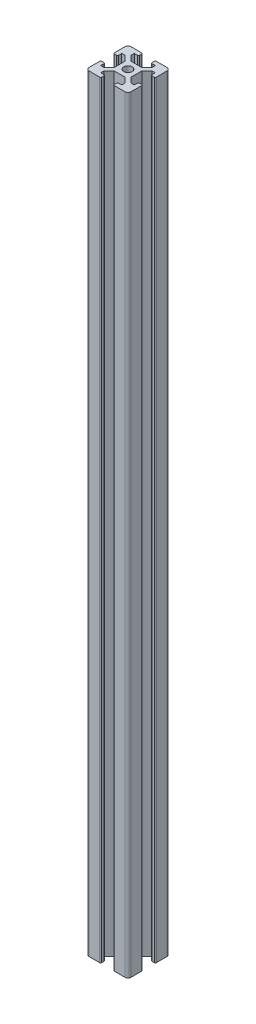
ISO-10303-21;
HEADER;
FILE_DESCRIPTION(('STEP AP214'),'2;1');
FILE_NAME('part.step','',(''),(''),'','','');
FILE_SCHEMA(('AUTOMOTIVE_DESIGN { 1 0 10303 214 1 1 1 1 }'));
ENDSEC;
DATA;
#1=APPLICATION_CONTEXT('core data for automotive mechanical design processes');
#2=APPLICATION_PROTOCOL_DEFINITION('international standard','automotive_design',2000,#1);
#3=PRODUCT_CONTEXT('',#1,'mechanical');
#4=PRODUCT('Part','Part','',(#3));
#5=PRODUCT_RELATED_PRODUCT_CATEGORY('part','',(#4));
#6=PRODUCT_DEFINITION_FORMATION('','',#4);
#7=PRODUCT_DEFINITION_CONTEXT('part definition',#1,'design');
#8=PRODUCT_DEFINITION('design','',#6,#7);
#9=PRODUCT_DEFINITION_SHAPE('','',#8);
#10=(LENGTH_UNIT() NAMED_UNIT(*) SI_UNIT(.MILLI.,.METRE.));
#11=(NAMED_UNIT(*) PLANE_ANGLE_UNIT() SI_UNIT($,.RADIAN.));
#12=(NAMED_UNIT(*) SI_UNIT($,.STERADIAN.) SOLID_ANGLE_UNIT());
#13=UNCERTAINTY_MEASURE_WITH_UNIT(LENGTH_MEASURE(1.E-05),#10,'distance_accuracy_value','');
#14=(GEOMETRIC_REPRESENTATION_CONTEXT(3) GLOBAL_UNCERTAINTY_ASSIGNED_CONTEXT((#13)) GLOBAL_UNIT_ASSIGNED_CONTEXT((#10,
#11,#12)) REPRESENTATION_CONTEXT('',''));
#15=CARTESIAN_POINT('',(0.,0.,0.));
#16=DIRECTION('',(0.,0.,1.));
#17=DIRECTION('',(1.,0.,0.));
#18=AXIS2_PLACEMENT_3D('',#15,#16,#17);
#19=CARTESIAN_POINT('',(0.,365.,0.));
#20=DIRECTION('',(0.,-1.,0.));
#21=DIRECTION('',(0.,0.,-1.));
#22=AXIS2_PLACEMENT_3D('',#19,#20,#21);
#23=PLANE('',#22);
#24=DIRECTION('',(0.,0.,1.));
#25=VECTOR('',#24,1.);
#26=CARTESIAN_POINT('',(3.,365.,10.));
#27=LINE('',#26,#25);
#28=CARTESIAN_POINT('',(3.,365.,8.5));
#29=VERTEX_POINT('',#28);
#30=CARTESIAN_POINT('',(3.,365.,9.5));
#31=VERTEX_POINT('',#30);
#32=EDGE_CURVE('E570',#29,#31,#27,.T.);
#33=ORIENTED_EDGE('',*,*,#32,.T.);
#34=CARTESIAN_POINT('',(3.5,365.,9.5));
#35=DIRECTION('',(0.,-1.,0.));
#36=DIRECTION('',(0.,0.,-1.));
#37=AXIS2_PLACEMENT_3D('',#34,#35,#36);
#38=CIRCLE('',#37,0.5);
#39=CARTESIAN_POINT('',(3.5,365.,10.));
#40=VERTEX_POINT('',#39);
#41=EDGE_CURVE('E1009',#31,#40,#38,.F.);
#42=ORIENTED_EDGE('',*,*,#41,.T.);
#43=DIRECTION('',(1.,0.,0.));
#44=VECTOR('',#43,1.);
#45=CARTESIAN_POINT('',(3.,365.,10.));
#46=LINE('',#45,#44);
#47=CARTESIAN_POINT('',(8.5,365.,10.));
#48=VERTEX_POINT('',#47);
#49=EDGE_CURVE('E573',#40,#48,#46,.T.);
#50=ORIENTED_EDGE('',*,*,#49,.T.);
#51=CARTESIAN_POINT('',(8.5,365.,8.5));
#52=DIRECTION('',(0.,-1.,0.));
#53=DIRECTION('',(0.,0.,-1.));
#54=AXIS2_PLACEMENT_3D('',#51,#52,#53);
#55=CIRCLE('',#54,1.5);
#56=CARTESIAN_POINT('',(10.,365.,8.5));
#57=VERTEX_POINT('',#56);
#58=EDGE_CURVE('E880',#48,#57,#55,.F.);
#59=ORIENTED_EDGE('',*,*,#58,.T.);
#60=DIRECTION('',(0.,0.,-1.));
#61=VECTOR('',#60,1.);
#62=CARTESIAN_POINT('',(10.,365.,10.));
#63=LINE('',#62,#61);
#64=CARTESIAN_POINT('',(10.,365.,3.5));
#65=VERTEX_POINT('',#64);
#66=EDGE_CURVE('E576',#57,#65,#63,.T.);
#67=ORIENTED_EDGE('',*,*,#66,.T.);
#68=CARTESIAN_POINT('',(9.5,365.,3.5));
#69=DIRECTION('',(0.,-1.,0.));
#70=DIRECTION('',(0.,0.,-1.));
#71=AXIS2_PLACEMENT_3D('',#68,#69,#70);
#72=CIRCLE('',#71,0.5);
#73=CARTESIAN_POINT('',(9.5,365.,3.));
#74=VERTEX_POINT('',#73);
#75=EDGE_CURVE('E992',#65,#74,#72,.F.);
#76=ORIENTED_EDGE('',*,*,#75,.T.);
#77=DIRECTION('',(-1.,0.,0.));
#78=VECTOR('',#77,1.);
#79=CARTESIAN_POINT('',(10.,365.,3.));
#80=LINE('',#79,#78);
#81=CARTESIAN_POINT('',(8.5,365.,3.));
#82=VERTEX_POINT('',#81);
#83=EDGE_CURVE('E580',#74,#82,#80,.T.);
#84=ORIENTED_EDGE('',*,*,#83,.T.);
#85=CARTESIAN_POINT('',(8.5,365.,3.5));
#86=DIRECTION('',(0.,-1.,0.));
#87=DIRECTION('',(0.,0.,-1.));
#88=AXIS2_PLACEMENT_3D('',#85,#86,#87);
#89=CIRCLE('',#88,0.5);
#90=CARTESIAN_POINT('',(8.,365.,3.5));
#91=VERTEX_POINT('',#90);
#92=EDGE_CURVE('E989',#82,#91,#89,.F.);
#93=ORIENTED_EDGE('',*,*,#92,.T.);
#94=DIRECTION('',(0.,0.,1.));
#95=VECTOR('',#94,1.);
#96=CARTESIAN_POINT('',(8.,365.,3.));
#97=LINE('',#96,#95);
#98=CARTESIAN_POINT('',(8.,365.,5.));
#99=VERTEX_POINT('',#98);
#100=EDGE_CURVE('E584',#91,#99,#97,.T.);
#101=ORIENTED_EDGE('',*,*,#100,.T.);
#102=DIRECTION('',(-1.,0.,0.));
#103=VECTOR('',#102,1.);
#104=CARTESIAN_POINT('',(8.,365.,5.));
#105=LINE('',#104,#103);
#106=CARTESIAN_POINT('',(6.41421356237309,365.,5.));
#107=VERTEX_POINT('',#106);
#108=EDGE_CURVE('E587',#99,#107,#105,.T.);
#109=ORIENTED_EDGE('',*,*,#108,.T.);
#110=DIRECTION('',(-0.707106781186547,0.,-0.707106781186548));
#111=VECTOR('',#110,1.);
#112=CARTESIAN_POINT('',(4.,365.,2.58578643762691));
#113=LINE('',#112,#111);
#114=CARTESIAN_POINT('',(4.,365.,2.58578643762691));
#115=VERTEX_POINT('',#114);
#116=EDGE_CURVE('E590',#107,#115,#113,.T.);
#117=ORIENTED_EDGE('',*,*,#116,.T.);
#118=DIRECTION('',(0.,0.,-1.));
#119=VECTOR('',#118,1.);
#120=CARTESIAN_POINT('',(4.,365.,2.58578643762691));
#121=LINE('',#120,#119);
#122=CARTESIAN_POINT('',(4.,365.,-2.58578643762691));
#123=VERTEX_POINT('',#122);
#124=EDGE_CURVE('E593',#115,#123,#121,.T.);
#125=ORIENTED_EDGE('',*,*,#124,.T.);
#126=DIRECTION('',(0.707106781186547,0.,-0.707106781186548));
#127=VECTOR('',#126,1.);
#128=CARTESIAN_POINT('',(4.,365.,-2.58578643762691));
#129=LINE('',#128,#127);
#130=CARTESIAN_POINT('',(6.41421356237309,365.,-5.));
#131=VERTEX_POINT('',#130);
#132=EDGE_CURVE('E596',#123,#131,#129,.T.);
#133=ORIENTED_EDGE('',*,*,#132,.T.);
#134=DIRECTION('',(1.,0.,0.));
#135=VECTOR('',#134,1.);
#136=CARTESIAN_POINT('',(8.,365.,-5.));
#137=LINE('',#136,#135);
#138=CARTESIAN_POINT('',(8.,365.,-5.));
#139=VERTEX_POINT('',#138);
#140=EDGE_CURVE('E599',#131,#139,#137,.T.);
#141=ORIENTED_EDGE('',*,*,#140,.T.);
#142=DIRECTION('',(0.,0.,1.));
#143=VECTOR('',#142,1.);
#144=CARTESIAN_POINT('',(8.,365.,-3.));
#145=LINE('',#144,#143);
#146=CARTESIAN_POINT('',(8.,365.,-3.5));
#147=VERTEX_POINT('',#146);
#148=EDGE_CURVE('E602',#139,#147,#145,.T.);
#149=ORIENTED_EDGE('',*,*,#148,.T.);
#150=CARTESIAN_POINT('',(8.5,365.,-3.5));
#151=DIRECTION('',(0.,-1.,0.));
#152=DIRECTION('',(0.,0.,-1.));
#153=AXIS2_PLACEMENT_3D('',#150,#151,#152);
#154=CIRCLE('',#153,0.5);
#155=CARTESIAN_POINT('',(8.5,365.,-3.));
#156=VERTEX_POINT('',#155);
#157=EDGE_CURVE('E975',#147,#156,#154,.F.);
#158=ORIENTED_EDGE('',*,*,#157,.T.);
#159=DIRECTION('',(1.,0.,0.));
#160=VECTOR('',#159,1.);
#161=CARTESIAN_POINT('',(10.,365.,-3.));
#162=LINE('',#161,#160);
#163=CARTESIAN_POINT('',(9.5,365.,-3.));
#164=VERTEX_POINT('',#163);
#165=EDGE_CURVE('E606',#156,#164,#162,.T.);
#166=ORIENTED_EDGE('',*,*,#165,.T.);
#167=CARTESIAN_POINT('',(9.5,365.,-3.5));
#168=DIRECTION('',(0.,-1.,0.));
#169=DIRECTION('',(0.,0.,-1.));
#170=AXIS2_PLACEMENT_3D('',#167,#168,#169);
#171=CIRCLE('',#170,0.5);
#172=CARTESIAN_POINT('',(10.,365.,-3.5));
#173=VERTEX_POINT('',#172);
#174=EDGE_CURVE('E972',#164,#173,#171,.F.);
#175=ORIENTED_EDGE('',*,*,#174,.T.);
#176=DIRECTION('',(0.,0.,-1.));
#177=VECTOR('',#176,1.);
#178=CARTESIAN_POINT('',(10.,365.,-10.));
#179=LINE('',#178,#177);
#180=CARTESIAN_POINT('',(10.,365.,-8.5));
#181=VERTEX_POINT('',#180);
#182=EDGE_CURVE('E758',#173,#181,#179,.T.);
#183=ORIENTED_EDGE('',*,*,#182,.T.);
#184=CARTESIAN_POINT('',(8.5,365.,-8.5));
#185=DIRECTION('',(0.,-1.,0.));
#186=DIRECTION('',(0.,0.,-1.));
#187=AXIS2_PLACEMENT_3D('',#184,#185,#186);
#188=CIRCLE('',#187,1.5);
#189=CARTESIAN_POINT('',(8.5,365.,-10.));
#190=VERTEX_POINT('',#189);
#191=EDGE_CURVE('E871',#181,#190,#188,.F.);
#192=ORIENTED_EDGE('',*,*,#191,.T.);
#193=DIRECTION('',(-1.,0.,0.));
#194=VECTOR('',#193,1.);
#195=CARTESIAN_POINT('',(3.,365.,-10.));
#196=LINE('',#195,#194);
#197=CARTESIAN_POINT('',(3.5,365.,-10.));
#198=VERTEX_POINT('',#197);
#199=EDGE_CURVE('E1109',#190,#198,#196,.T.);
#200=ORIENTED_EDGE('',*,*,#199,.T.);
#201=CARTESIAN_POINT('',(3.5,365.,-9.5));
#202=DIRECTION('',(0.,-1.,0.));
#203=DIRECTION('',(0.,0.,-1.));
#204=AXIS2_PLACEMENT_3D('',#201,#202,#203);
#205=CIRCLE('',#204,0.5);
#206=CARTESIAN_POINT('',(3.,365.,-9.5));
#207=VERTEX_POINT('',#206);
#208=EDGE_CURVE('E969',#198,#207,#205,.F.);
#209=ORIENTED_EDGE('',*,*,#208,.T.);
#210=DIRECTION('',(0.,0.,1.));
#211=VECTOR('',#210,1.);
#212=CARTESIAN_POINT('',(3.,365.,-10.));
#213=LINE('',#212,#211);
#214=CARTESIAN_POINT('',(3.,365.,-8.5));
#215=VERTEX_POINT('',#214);
#216=EDGE_CURVE('E462',#207,#215,#213,.T.);
#217=ORIENTED_EDGE('',*,*,#216,.T.);
#218=CARTESIAN_POINT('',(3.5,365.,-8.5));
#219=DIRECTION('',(0.,-1.,0.));
#220=DIRECTION('',(0.,0.,-1.));
#221=AXIS2_PLACEMENT_3D('',#218,#219,#220);
#222=CIRCLE('',#221,0.5);
#223=CARTESIAN_POINT('',(3.5,365.,-8.));
#224=VERTEX_POINT('',#223);
#225=EDGE_CURVE('E457',#215,#224,#222,.F.);
#226=ORIENTED_EDGE('',*,*,#225,.T.);
#227=DIRECTION('',(1.,0.,0.));
#228=VECTOR('',#227,1.);
#229=CARTESIAN_POINT('',(3.,365.,-8.));
#230=LINE('',#229,#228);
#231=CARTESIAN_POINT('',(5.,365.,-8.));
#232=VERTEX_POINT('',#231);
#233=EDGE_CURVE('E448',#224,#232,#230,.T.);
#234=ORIENTED_EDGE('',*,*,#233,.T.);
#235=DIRECTION('',(0.,0.,1.));
#236=VECTOR('',#235,1.);
#237=CARTESIAN_POINT('',(5.,365.,-8.));
#238=LINE('',#237,#236);
#239=CARTESIAN_POINT('',(5.,365.,-6.4142135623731));
#240=VERTEX_POINT('',#239);
#241=EDGE_CURVE('E453',#232,#240,#238,.T.);
#242=ORIENTED_EDGE('',*,*,#241,.T.);
#243=DIRECTION('',(-0.707106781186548,0.,0.707106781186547));
#244=VECTOR('',#243,1.);
#245=CARTESIAN_POINT('',(2.5857864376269,365.,-4.));
#246=LINE('',#245,#244);
#247=CARTESIAN_POINT('',(2.5857864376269,365.,-4.));
#248=VERTEX_POINT('',#247);
#249=EDGE_CURVE('E479',#240,#248,#246,.T.);
#250=ORIENTED_EDGE('',*,*,#249,.T.);
#251=DIRECTION('',(-1.,0.,0.));
#252=VECTOR('',#251,1.);
#253=CARTESIAN_POINT('',(-2.5857864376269,365.,-4.));
#254=LINE('',#253,#252);
#255=CARTESIAN_POINT('',(-2.5857864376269,365.,-4.));
#256=VERTEX_POINT('',#255);
#257=EDGE_CURVE('E482',#248,#256,#254,.T.);
#258=ORIENTED_EDGE('',*,*,#257,.T.);
#259=DIRECTION('',(-0.707106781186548,0.,-0.707106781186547));
#260=VECTOR('',#259,1.);
#261=CARTESIAN_POINT('',(-2.5857864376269,365.,-4.));
#262=LINE('',#261,#260);
#263=CARTESIAN_POINT('',(-5.,365.,-6.4142135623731));
#264=VERTEX_POINT('',#263);
#265=EDGE_CURVE('E488',#256,#264,#262,.T.);
#266=ORIENTED_EDGE('',*,*,#265,.T.);
#267=DIRECTION('',(0.,0.,-1.));
#268=VECTOR('',#267,1.);
#269=CARTESIAN_POINT('',(-5.,365.,-8.));
#270=LINE('',#269,#268);
#271=CARTESIAN_POINT('',(-5.,365.,-8.));
#272=VERTEX_POINT('',#271);
#273=EDGE_CURVE('E491',#264,#272,#270,.T.);
#274=ORIENTED_EDGE('',*,*,#273,.T.);
#275=DIRECTION('',(1.,0.,0.));
#276=VECTOR('',#275,1.);
#277=CARTESIAN_POINT('',(-3.,365.,-8.));
#278=LINE('',#277,#276);
#279=CARTESIAN_POINT('',(-3.5,365.,-8.));
#280=VERTEX_POINT('',#279);
#281=EDGE_CURVE('E494',#272,#280,#278,.T.);
#282=ORIENTED_EDGE('',*,*,#281,.T.);
#283=CARTESIAN_POINT('',(-3.5,365.,-8.5));
#284=DIRECTION('',(0.,-1.,0.));
#285=DIRECTION('',(0.,0.,-1.));
#286=AXIS2_PLACEMENT_3D('',#283,#284,#285);
#287=CIRCLE('',#286,0.5);
#288=CARTESIAN_POINT('',(-3.,365.,-8.5));
#289=VERTEX_POINT('',#288);
#290=EDGE_CURVE('E980',#280,#289,#287,.F.);
#291=ORIENTED_EDGE('',*,*,#290,.T.);
#292=DIRECTION('',(0.,0.,-1.));
#293=VECTOR('',#292,1.);
#294=CARTESIAN_POINT('',(-3.,365.,-10.));
#295=LINE('',#294,#293);
#296=CARTESIAN_POINT('',(-3.,365.,-9.5));
#297=VERTEX_POINT('',#296);
#298=EDGE_CURVE('E498',#289,#297,#295,.T.);
#299=ORIENTED_EDGE('',*,*,#298,.T.);
#300=CARTESIAN_POINT('',(-3.5,365.,-9.5));
#301=DIRECTION('',(0.,-1.,0.));
#302=DIRECTION('',(0.,0.,-1.));
#303=AXIS2_PLACEMENT_3D('',#300,#301,#302);
#304=CIRCLE('',#303,0.5);
#305=CARTESIAN_POINT('',(-3.5,365.,-10.));
#306=VERTEX_POINT('',#305);
#307=EDGE_CURVE('E966',#297,#306,#304,.F.);
#308=ORIENTED_EDGE('',*,*,#307,.T.);
#309=DIRECTION('',(-1.,0.,0.));
#310=VECTOR('',#309,1.);
#311=CARTESIAN_POINT('',(-10.,365.,-10.));
#312=LINE('',#311,#310);
#313=CARTESIAN_POINT('',(-8.5,365.,-10.));
#314=VERTEX_POINT('',#313);
#315=EDGE_CURVE('E502',#306,#314,#312,.T.);
#316=ORIENTED_EDGE('',*,*,#315,.T.);
#317=CARTESIAN_POINT('',(-8.5,365.,-8.5));
#318=DIRECTION('',(0.,-1.,0.));
#319=DIRECTION('',(0.,0.,-1.));
#320=AXIS2_PLACEMENT_3D('',#317,#318,#319);
#321=CIRCLE('',#320,1.5);
#322=CARTESIAN_POINT('',(-10.,365.,-8.5));
#323=VERTEX_POINT('',#322);
#324=EDGE_CURVE('E874',#314,#323,#321,.F.);
#325=ORIENTED_EDGE('',*,*,#324,.T.);
#326=DIRECTION('',(0.,0.,1.));
#327=VECTOR('',#326,1.);
#328=CARTESIAN_POINT('',(-10.,365.,-10.));
#329=LINE('',#328,#327);
#330=CARTESIAN_POINT('',(-10.,365.,-3.5));
#331=VERTEX_POINT('',#330);
#332=EDGE_CURVE('E505',#323,#331,#329,.T.);
#333=ORIENTED_EDGE('',*,*,#332,.T.);
#334=CARTESIAN_POINT('',(-9.5,365.,-3.5));
#335=DIRECTION('',(0.,-1.,0.));
#336=DIRECTION('',(0.,0.,-1.));
#337=AXIS2_PLACEMENT_3D('',#334,#335,#336);
#338=CIRCLE('',#337,0.5);
#339=CARTESIAN_POINT('',(-9.5,365.,-3.));
#340=VERTEX_POINT('',#339);
#341=EDGE_CURVE('E986',#331,#340,#338,.F.);
#342=ORIENTED_EDGE('',*,*,#341,.T.);
#343=DIRECTION('',(1.,0.,0.));
#344=VECTOR('',#343,1.);
#345=CARTESIAN_POINT('',(-10.,365.,-3.));
#346=LINE('',#345,#344);
#347=CARTESIAN_POINT('',(-8.5,365.,-3.));
#348=VERTEX_POINT('',#347);
#349=EDGE_CURVE('E509',#340,#348,#346,.T.);
#350=ORIENTED_EDGE('',*,*,#349,.T.);
#351=CARTESIAN_POINT('',(-8.5,365.,-3.5));
#352=DIRECTION('',(0.,-1.,0.));
#353=DIRECTION('',(0.,0.,-1.));
#354=AXIS2_PLACEMENT_3D('',#351,#352,#353);
#355=CIRCLE('',#354,0.5);
#356=CARTESIAN_POINT('',(-8.,365.,-3.5));
#357=VERTEX_POINT('',#356);
#358=EDGE_CURVE('E983',#348,#357,#355,.F.);
#359=ORIENTED_EDGE('',*,*,#358,.T.);
#360=DIRECTION('',(0.,0.,-1.));
#361=VECTOR('',#360,1.);
#362=CARTESIAN_POINT('',(-8.,365.,-3.));
#363=LINE('',#362,#361);
#364=CARTESIAN_POINT('',(-8.,365.,-5.));
#365=VERTEX_POINT('',#364);
#366=EDGE_CURVE('E513',#357,#365,#363,.T.);
#367=ORIENTED_EDGE('',*,*,#366,.T.);
#368=DIRECTION('',(1.,0.,0.));
#369=VECTOR('',#368,1.);
#370=CARTESIAN_POINT('',(-8.,365.,-5.));
#371=LINE('',#370,#369);
#372=CARTESIAN_POINT('',(-6.41421356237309,365.,-5.));
#373=VERTEX_POINT('',#372);
#374=EDGE_CURVE('E516',#365,#373,#371,.T.);
#375=ORIENTED_EDGE('',*,*,#374,.T.);
#376=DIRECTION('',(0.707106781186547,0.,0.707106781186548));
#377=VECTOR('',#376,1.);
#378=CARTESIAN_POINT('',(-4.,365.,-2.58578643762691));
#379=LINE('',#378,#377);
#380=CARTESIAN_POINT('',(-4.,365.,-2.58578643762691));
#381=VERTEX_POINT('',#380);
#382=EDGE_CURVE('E519',#373,#381,#379,.T.);
#383=ORIENTED_EDGE('',*,*,#382,.T.);
#384=DIRECTION('',(0.,0.,1.));
#385=VECTOR('',#384,1.);
#386=CARTESIAN_POINT('',(-4.,365.,2.58578643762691));
#387=LINE('',#386,#385);
#388=CARTESIAN_POINT('',(-4.,365.,2.58578643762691));
#389=VERTEX_POINT('',#388);
#390=EDGE_CURVE('E522',#381,#389,#387,.T.);
#391=ORIENTED_EDGE('',*,*,#390,.T.);
#392=DIRECTION('',(-0.707106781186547,0.,0.707106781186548));
#393=VECTOR('',#392,1.);
#394=CARTESIAN_POINT('',(-4.,365.,2.58578643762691));
#395=LINE('',#394,#393);
#396=CARTESIAN_POINT('',(-6.41421356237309,365.,5.));
#397=VERTEX_POINT('',#396);
#398=EDGE_CURVE('E525',#389,#397,#395,.T.);
#399=ORIENTED_EDGE('',*,*,#398,.T.);
#400=DIRECTION('',(-1.,0.,0.));
#401=VECTOR('',#400,1.);
#402=CARTESIAN_POINT('',(-8.,365.,5.));
#403=LINE('',#402,#401);
#404=CARTESIAN_POINT('',(-8.,365.,5.));
#405=VERTEX_POINT('',#404);
#406=EDGE_CURVE('E528',#397,#405,#403,.T.);
#407=ORIENTED_EDGE('',*,*,#406,.T.);
#408=DIRECTION('',(0.,0.,-1.));
#409=VECTOR('',#408,1.);
#410=CARTESIAN_POINT('',(-8.,365.,3.));
#411=LINE('',#410,#409);
#412=CARTESIAN_POINT('',(-8.,365.,3.5));
#413=VERTEX_POINT('',#412);
#414=EDGE_CURVE('E531',#405,#413,#411,.T.);
#415=ORIENTED_EDGE('',*,*,#414,.T.);
#416=CARTESIAN_POINT('',(-8.5,365.,3.5));
#417=DIRECTION('',(0.,-1.,0.));
#418=DIRECTION('',(0.,0.,-1.));
#419=AXIS2_PLACEMENT_3D('',#416,#417,#418);
#420=CIRCLE('',#419,0.5);
#421=CARTESIAN_POINT('',(-8.5,365.,3.));
#422=VERTEX_POINT('',#421);
#423=EDGE_CURVE('E995',#413,#422,#420,.F.);
#424=ORIENTED_EDGE('',*,*,#423,.T.);
#425=DIRECTION('',(-1.,0.,0.));
#426=VECTOR('',#425,1.);
#427=CARTESIAN_POINT('',(-10.,365.,3.));
#428=LINE('',#427,#426);
#429=CARTESIAN_POINT('',(-9.5,365.,3.));
#430=VERTEX_POINT('',#429);
#431=EDGE_CURVE('E535',#422,#430,#428,.T.);
#432=ORIENTED_EDGE('',*,*,#431,.T.);
#433=CARTESIAN_POINT('',(-9.5,365.,3.5));
#434=DIRECTION('',(0.,-1.,0.));
#435=DIRECTION('',(0.,0.,-1.));
#436=AXIS2_PLACEMENT_3D('',#433,#434,#435);
#437=CIRCLE('',#436,0.5);
#438=CARTESIAN_POINT('',(-10.,365.,3.5));
#439=VERTEX_POINT('',#438);
#440=EDGE_CURVE('E998',#430,#439,#437,.F.);
#441=ORIENTED_EDGE('',*,*,#440,.T.);
#442=DIRECTION('',(0.,0.,1.));
#443=VECTOR('',#442,1.);
#444=CARTESIAN_POINT('',(-10.,365.,3.));
#445=LINE('',#444,#443);
#446=CARTESIAN_POINT('',(-10.,365.,8.5));
#447=VERTEX_POINT('',#446);
#448=EDGE_CURVE('E539',#439,#447,#445,.T.);
#449=ORIENTED_EDGE('',*,*,#448,.T.);
#450=CARTESIAN_POINT('',(-8.5,365.,8.5));
#451=DIRECTION('',(0.,-1.,0.));
#452=DIRECTION('',(0.,0.,-1.));
#453=AXIS2_PLACEMENT_3D('',#450,#451,#452);
#454=CIRCLE('',#453,1.5);
#455=CARTESIAN_POINT('',(-8.5,365.,10.));
#456=VERTEX_POINT('',#455);
#457=EDGE_CURVE('E877',#447,#456,#454,.F.);
#458=ORIENTED_EDGE('',*,*,#457,.T.);
#459=DIRECTION('',(1.,0.,0.));
#460=VECTOR('',#459,1.);
#461=CARTESIAN_POINT('',(-10.,365.,10.));
#462=LINE('',#461,#460);
#463=CARTESIAN_POINT('',(-3.5,365.,10.));
#464=VERTEX_POINT('',#463);
#465=EDGE_CURVE('E542',#456,#464,#462,.T.);
#466=ORIENTED_EDGE('',*,*,#465,.T.);
#467=CARTESIAN_POINT('',(-3.5,365.,9.5));
#468=DIRECTION('',(0.,-1.,0.));
#469=DIRECTION('',(0.,0.,-1.));
#470=AXIS2_PLACEMENT_3D('',#467,#468,#469);
#471=CIRCLE('',#470,0.5);
#472=CARTESIAN_POINT('',(-3.,365.,9.5));
#473=VERTEX_POINT('',#472);
#474=EDGE_CURVE('E1003',#464,#473,#471,.F.);
#475=ORIENTED_EDGE('',*,*,#474,.T.);
#476=DIRECTION('',(0.,0.,-1.));
#477=VECTOR('',#476,1.);
#478=CARTESIAN_POINT('',(-3.,365.,10.));
#479=LINE('',#478,#477);
#480=CARTESIAN_POINT('',(-3.,365.,8.5));
#481=VERTEX_POINT('',#480);
#482=EDGE_CURVE('E546',#473,#481,#479,.T.);
#483=ORIENTED_EDGE('',*,*,#482,.T.);
#484=CARTESIAN_POINT('',(-3.5,365.,8.5));
#485=DIRECTION('',(0.,-1.,0.));
#486=DIRECTION('',(0.,0.,-1.));
#487=AXIS2_PLACEMENT_3D('',#484,#485,#486);
#488=CIRCLE('',#487,0.5);
#489=CARTESIAN_POINT('',(-3.5,365.,8.));
#490=VERTEX_POINT('',#489);
#491=EDGE_CURVE('E69',#481,#490,#488,.F.);
#492=ORIENTED_EDGE('',*,*,#491,.T.);
#493=DIRECTION('',(-1.,0.,0.));
#494=VECTOR('',#493,1.);
#495=CARTESIAN_POINT('',(-3.,365.,8.));
#496=LINE('',#495,#494);
#497=CARTESIAN_POINT('',(-5.,365.,8.));
#498=VERTEX_POINT('',#497);
#499=EDGE_CURVE('E549',#490,#498,#496,.T.);
#500=ORIENTED_EDGE('',*,*,#499,.T.);
#501=DIRECTION('',(0.,0.,-1.));
#502=VECTOR('',#501,1.);
#503=CARTESIAN_POINT('',(-5.,365.,8.));
#504=LINE('',#503,#502);
#505=CARTESIAN_POINT('',(-5.,365.,6.4142135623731));
#506=VERTEX_POINT('',#505);
#507=EDGE_CURVE('E552',#498,#506,#504,.T.);
#508=ORIENTED_EDGE('',*,*,#507,.T.);
#509=DIRECTION('',(0.707106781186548,0.,-0.707106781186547));
#510=VECTOR('',#509,1.);
#511=CARTESIAN_POINT('',(-2.5857864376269,365.,4.));
#512=LINE('',#511,#510);
#513=CARTESIAN_POINT('',(-2.5857864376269,365.,4.));
#514=VERTEX_POINT('',#513);
#515=EDGE_CURVE('E555',#506,#514,#512,.T.);
#516=ORIENTED_EDGE('',*,*,#515,.T.);
#517=DIRECTION('',(1.,0.,0.));
#518=VECTOR('',#517,1.);
#519=CARTESIAN_POINT('',(-2.5857864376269,365.,4.));
#520=LINE('',#519,#518);
#521=CARTESIAN_POINT('',(2.5857864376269,365.,4.));
#522=VERTEX_POINT('',#521);
#523=EDGE_CURVE('E558',#514,#522,#520,.T.);
#524=ORIENTED_EDGE('',*,*,#523,.T.);
#525=DIRECTION('',(0.707106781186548,0.,0.707106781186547));
#526=VECTOR('',#525,1.);
#527=CARTESIAN_POINT('',(2.5857864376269,365.,4.));
#528=LINE('',#527,#526);
#529=CARTESIAN_POINT('',(5.,365.,6.4142135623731));
#530=VERTEX_POINT('',#529);
#531=EDGE_CURVE('E561',#522,#530,#528,.T.);
#532=ORIENTED_EDGE('',*,*,#531,.T.);
#533=DIRECTION('',(0.,0.,1.));
#534=VECTOR('',#533,1.);
#535=CARTESIAN_POINT('',(5.,365.,8.));
#536=LINE('',#535,#534);
#537=CARTESIAN_POINT('',(5.,365.,8.));
#538=VERTEX_POINT('',#537);
#539=EDGE_CURVE('E564',#530,#538,#536,.T.);
#540=ORIENTED_EDGE('',*,*,#539,.T.);
#541=DIRECTION('',(-1.,0.,0.));
#542=VECTOR('',#541,1.);
#543=CARTESIAN_POINT('',(3.,365.,8.));
#544=LINE('',#543,#542);
#545=CARTESIAN_POINT('',(3.5,365.,8.));
#546=VERTEX_POINT('',#545);
#547=EDGE_CURVE('E567',#538,#546,#544,.T.);
#548=ORIENTED_EDGE('',*,*,#547,.T.);
#549=CARTESIAN_POINT('',(3.5,365.,8.5));
#550=DIRECTION('',(0.,-1.,0.));
#551=DIRECTION('',(0.,0.,-1.));
#552=AXIS2_PLACEMENT_3D('',#549,#550,#551);
#553=CIRCLE('',#552,0.5);
#554=EDGE_CURVE('E1006',#546,#29,#553,.F.);
#555=ORIENTED_EDGE('',*,*,#554,.T.);
#556=EDGE_LOOP('',(#33,#42,#50,#59,#67,#76,#84,#93,#101,#109,#117,#125,#133,#141,#149,#158,#166,
#175,#183,#192,#200,#209,#217,#226,#234,#242,#250,#258,#266,#274,#282,#291,#299,#308,#316,#325,
#333,#342,#350,#359,#367,#375,#383,#391,#399,#407,#415,#424,#432,#441,#449,#458,#466,#475,#483,
#492,#500,#508,#516,#524,#532,#540,#548,#555));
#557=FACE_BOUND('',#556,.T.);
#558=CARTESIAN_POINT('',(0.,365.,0.));
#559=DIRECTION('',(0.,1.,0.));
#560=DIRECTION('',(0.,0.,1.));
#561=AXIS2_PLACEMENT_3D('',#558,#559,#560);
#562=CIRCLE('',#561,2.);
#563=CARTESIAN_POINT('',(0.,365.,-2.));
#564=VERTEX_POINT('',#563);
#565=EDGE_CURVE('E615',#564,#564,#562,.T.);
#566=ORIENTED_EDGE('',*,*,#565,.F.);
#567=EDGE_LOOP('',(#566));
#568=FACE_BOUND('',#567,.T.);
#569=ADVANCED_FACE('F45',(#557,#568),#23,.F.);
#570=CARTESIAN_POINT('',(0.,0.,0.));
#571=DIRECTION('',(0.,-1.,0.));
#572=DIRECTION('',(0.,0.,-1.));
#573=AXIS2_PLACEMENT_3D('',#570,#571,#572);
#574=PLANE('',#573);
#575=DIRECTION('',(1.,0.,0.));
#576=VECTOR('',#575,1.);
#577=CARTESIAN_POINT('',(3.,0.,10.));
#578=LINE('',#577,#576);
#579=CARTESIAN_POINT('',(3.5,0.,10.));
#580=VERTEX_POINT('',#579);
#581=CARTESIAN_POINT('',(8.5,0.,10.));
#582=VERTEX_POINT('',#581);
#583=EDGE_CURVE('E721',#580,#582,#578,.T.);
#584=ORIENTED_EDGE('',*,*,#583,.F.);
#585=CARTESIAN_POINT('',(3.5,0.,9.5));
#586=DIRECTION('',(0.,-1.,0.));
#587=DIRECTION('',(0.,0.,-1.));
#588=AXIS2_PLACEMENT_3D('',#585,#586,#587);
#589=CIRCLE('',#588,0.5);
#590=CARTESIAN_POINT('',(3.,0.,9.5));
#591=VERTEX_POINT('',#590);
#592=EDGE_CURVE('E956',#580,#591,#589,.T.);
#593=ORIENTED_EDGE('',*,*,#592,.T.);
#594=DIRECTION('',(0.,0.,1.));
#595=VECTOR('',#594,1.);
#596=CARTESIAN_POINT('',(3.,0.,10.));
#597=LINE('',#596,#595);
#598=CARTESIAN_POINT('',(3.,0.,8.5));
#599=VERTEX_POINT('',#598);
#600=EDGE_CURVE('E717',#599,#591,#597,.T.);
#601=ORIENTED_EDGE('',*,*,#600,.F.);
#602=CARTESIAN_POINT('',(3.5,0.,8.5));
#603=DIRECTION('',(0.,-1.,0.));
#604=DIRECTION('',(0.,0.,-1.));
#605=AXIS2_PLACEMENT_3D('',#602,#603,#604);
#606=CIRCLE('',#605,0.5);
#607=CARTESIAN_POINT('',(3.5,0.,8.));
#608=VERTEX_POINT('',#607);
#609=EDGE_CURVE('E953',#599,#608,#606,.T.);
#610=ORIENTED_EDGE('',*,*,#609,.T.);
#611=DIRECTION('',(-1.,0.,0.));
#612=VECTOR('',#611,1.);
#613=CARTESIAN_POINT('',(3.,0.,8.));
#614=LINE('',#613,#612);
#615=CARTESIAN_POINT('',(5.,0.,8.));
#616=VERTEX_POINT('',#615);
#617=EDGE_CURVE('E714',#616,#608,#614,.T.);
#618=ORIENTED_EDGE('',*,*,#617,.F.);
#619=DIRECTION('',(0.,0.,1.));
#620=VECTOR('',#619,1.);
#621=CARTESIAN_POINT('',(5.,0.,8.));
#622=LINE('',#621,#620);
#623=CARTESIAN_POINT('',(5.,0.,6.4142135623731));
#624=VERTEX_POINT('',#623);
#625=EDGE_CURVE('E711',#624,#616,#622,.T.);
#626=ORIENTED_EDGE('',*,*,#625,.F.);
#627=DIRECTION('',(0.707106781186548,0.,0.707106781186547));
#628=VECTOR('',#627,1.);
#629=CARTESIAN_POINT('',(2.5857864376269,0.,4.));
#630=LINE('',#629,#628);
#631=CARTESIAN_POINT('',(2.5857864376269,0.,4.));
#632=VERTEX_POINT('',#631);
#633=EDGE_CURVE('E708',#632,#624,#630,.T.);
#634=ORIENTED_EDGE('',*,*,#633,.F.);
#635=DIRECTION('',(1.,0.,0.));
#636=VECTOR('',#635,1.);
#637=CARTESIAN_POINT('',(-2.5857864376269,0.,4.));
#638=LINE('',#637,#636);
#639=CARTESIAN_POINT('',(-2.5857864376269,0.,4.));
#640=VERTEX_POINT('',#639);
#641=EDGE_CURVE('E705',#640,#632,#638,.T.);
#642=ORIENTED_EDGE('',*,*,#641,.F.);
#643=DIRECTION('',(0.707106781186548,0.,-0.707106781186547));
#644=VECTOR('',#643,1.);
#645=CARTESIAN_POINT('',(-2.5857864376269,0.,4.));
#646=LINE('',#645,#644);
#647=CARTESIAN_POINT('',(-5.,0.,6.4142135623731));
#648=VERTEX_POINT('',#647);
#649=EDGE_CURVE('E702',#648,#640,#646,.T.);
#650=ORIENTED_EDGE('',*,*,#649,.F.);
#651=DIRECTION('',(0.,0.,-1.));
#652=VECTOR('',#651,1.);
#653=CARTESIAN_POINT('',(-5.,0.,8.));
#654=LINE('',#653,#652);
#655=CARTESIAN_POINT('',(-5.,0.,8.));
#656=VERTEX_POINT('',#655);
#657=EDGE_CURVE('E699',#656,#648,#654,.T.);
#658=ORIENTED_EDGE('',*,*,#657,.F.);
#659=DIRECTION('',(-1.,0.,0.));
#660=VECTOR('',#659,1.);
#661=CARTESIAN_POINT('',(-3.,0.,8.));
#662=LINE('',#661,#660);
#663=CARTESIAN_POINT('',(-3.5,0.,8.));
#664=VERTEX_POINT('',#663);
#665=EDGE_CURVE('E696',#664,#656,#662,.T.);
#666=ORIENTED_EDGE('',*,*,#665,.F.);
#667=CARTESIAN_POINT('',(-3.5,0.,8.5));
#668=DIRECTION('',(0.,-1.,0.));
#669=DIRECTION('',(0.,0.,-1.));
#670=AXIS2_PLACEMENT_3D('',#667,#668,#669);
#671=CIRCLE('',#670,0.5);
#672=CARTESIAN_POINT('',(-3.,0.,8.5));
#673=VERTEX_POINT('',#672);
#674=EDGE_CURVE('E947',#664,#673,#671,.T.);
#675=ORIENTED_EDGE('',*,*,#674,.T.);
#676=DIRECTION('',(0.,0.,-1.));
#677=VECTOR('',#676,1.);
#678=CARTESIAN_POINT('',(-3.,0.,10.));
#679=LINE('',#678,#677);
#680=CARTESIAN_POINT('',(-3.,0.,9.5));
#681=VERTEX_POINT('',#680);
#682=EDGE_CURVE('E692',#681,#673,#679,.T.);
#683=ORIENTED_EDGE('',*,*,#682,.F.);
#684=CARTESIAN_POINT('',(-3.5,0.,9.5));
#685=DIRECTION('',(0.,-1.,0.));
#686=DIRECTION('',(0.,0.,-1.));
#687=AXIS2_PLACEMENT_3D('',#684,#685,#686);
#688=CIRCLE('',#687,0.5);
#689=CARTESIAN_POINT('',(-3.5,0.,10.));
#690=VERTEX_POINT('',#689);
#691=EDGE_CURVE('E950',#681,#690,#688,.T.);
#692=ORIENTED_EDGE('',*,*,#691,.T.);
#693=DIRECTION('',(1.,0.,0.));
#694=VECTOR('',#693,1.);
#695=CARTESIAN_POINT('',(-10.,0.,10.));
#696=LINE('',#695,#694);
#697=CARTESIAN_POINT('',(-8.5,0.,10.));
#698=VERTEX_POINT('',#697);
#699=EDGE_CURVE('E688',#698,#690,#696,.T.);
#700=ORIENTED_EDGE('',*,*,#699,.F.);
#701=CARTESIAN_POINT('',(-8.5,0.,8.5));
#702=DIRECTION('',(0.,-1.,0.));
#703=DIRECTION('',(0.,0.,-1.));
#704=AXIS2_PLACEMENT_3D('',#701,#702,#703);
#705=CIRCLE('',#704,1.5);
#706=CARTESIAN_POINT('',(-10.,0.,8.5));
#707=VERTEX_POINT('',#706);
#708=EDGE_CURVE('E859',#698,#707,#705,.T.);
#709=ORIENTED_EDGE('',*,*,#708,.T.);
#710=DIRECTION('',(0.,0.,1.));
#711=VECTOR('',#710,1.);
#712=CARTESIAN_POINT('',(-10.,0.,3.));
#713=LINE('',#712,#711);
#714=CARTESIAN_POINT('',(-10.,0.,3.5));
#715=VERTEX_POINT('',#714);
#716=EDGE_CURVE('E685',#715,#707,#713,.T.);
#717=ORIENTED_EDGE('',*,*,#716,.F.);
#718=CARTESIAN_POINT('',(-9.5,0.,3.5));
#719=DIRECTION('',(0.,-1.,0.));
#720=DIRECTION('',(0.,0.,-1.));
#721=AXIS2_PLACEMENT_3D('',#718,#719,#720);
#722=CIRCLE('',#721,0.5);
#723=CARTESIAN_POINT('',(-9.5,0.,3.));
#724=VERTEX_POINT('',#723);
#725=EDGE_CURVE('E944',#715,#724,#722,.T.);
#726=ORIENTED_EDGE('',*,*,#725,.T.);
#727=DIRECTION('',(-1.,0.,0.));
#728=VECTOR('',#727,1.);
#729=CARTESIAN_POINT('',(-10.,0.,3.));
#730=LINE('',#729,#728);
#731=CARTESIAN_POINT('',(-8.5,0.,3.));
#732=VERTEX_POINT('',#731);
#733=EDGE_CURVE('E681',#732,#724,#730,.T.);
#734=ORIENTED_EDGE('',*,*,#733,.F.);
#735=CARTESIAN_POINT('',(-8.5,0.,3.5));
#736=DIRECTION('',(0.,-1.,0.));
#737=DIRECTION('',(0.,0.,-1.));
#738=AXIS2_PLACEMENT_3D('',#735,#736,#737);
#739=CIRCLE('',#738,0.5);
#740=CARTESIAN_POINT('',(-8.,0.,3.5));
#741=VERTEX_POINT('',#740);
#742=EDGE_CURVE('E941',#732,#741,#739,.T.);
#743=ORIENTED_EDGE('',*,*,#742,.T.);
#744=DIRECTION('',(0.,0.,-1.));
#745=VECTOR('',#744,1.);
#746=CARTESIAN_POINT('',(-8.,0.,3.));
#747=LINE('',#746,#745);
#748=CARTESIAN_POINT('',(-8.,0.,5.));
#749=VERTEX_POINT('',#748);
#750=EDGE_CURVE('E677',#749,#741,#747,.T.);
#751=ORIENTED_EDGE('',*,*,#750,.F.);
#752=DIRECTION('',(-1.,0.,0.));
#753=VECTOR('',#752,1.);
#754=CARTESIAN_POINT('',(-8.,0.,5.));
#755=LINE('',#754,#753);
#756=CARTESIAN_POINT('',(-6.41421356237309,0.,5.));
#757=VERTEX_POINT('',#756);
#758=EDGE_CURVE('E674',#757,#749,#755,.T.);
#759=ORIENTED_EDGE('',*,*,#758,.F.);
#760=DIRECTION('',(-0.707106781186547,0.,0.707106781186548));
#761=VECTOR('',#760,1.);
#762=CARTESIAN_POINT('',(-4.,0.,2.58578643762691));
#763=LINE('',#762,#761);
#764=CARTESIAN_POINT('',(-4.,0.,2.58578643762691));
#765=VERTEX_POINT('',#764);
#766=EDGE_CURVE('E671',#765,#757,#763,.T.);
#767=ORIENTED_EDGE('',*,*,#766,.F.);
#768=DIRECTION('',(0.,0.,1.));
#769=VECTOR('',#768,1.);
#770=CARTESIAN_POINT('',(-4.,0.,2.58578643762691));
#771=LINE('',#770,#769);
#772=CARTESIAN_POINT('',(-4.,0.,-2.58578643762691));
#773=VERTEX_POINT('',#772);
#774=EDGE_CURVE('E668',#773,#765,#771,.T.);
#775=ORIENTED_EDGE('',*,*,#774,.F.);
#776=DIRECTION('',(0.707106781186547,0.,0.707106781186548));
#777=VECTOR('',#776,1.);
#778=CARTESIAN_POINT('',(-4.,0.,-2.58578643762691));
#779=LINE('',#778,#777);
#780=CARTESIAN_POINT('',(-6.41421356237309,0.,-5.));
#781=VERTEX_POINT('',#780);
#782=EDGE_CURVE('E665',#781,#773,#779,.T.);
#783=ORIENTED_EDGE('',*,*,#782,.F.);
#784=DIRECTION('',(1.,0.,0.));
#785=VECTOR('',#784,1.);
#786=CARTESIAN_POINT('',(-8.,0.,-5.));
#787=LINE('',#786,#785);
#788=CARTESIAN_POINT('',(-8.,0.,-5.));
#789=VERTEX_POINT('',#788);
#790=EDGE_CURVE('E662',#789,#781,#787,.T.);
#791=ORIENTED_EDGE('',*,*,#790,.F.);
#792=DIRECTION('',(0.,0.,-1.));
#793=VECTOR('',#792,1.);
#794=CARTESIAN_POINT('',(-8.,0.,-3.));
#795=LINE('',#794,#793);
#796=CARTESIAN_POINT('',(-8.,0.,-3.5));
#797=VERTEX_POINT('',#796);
#798=EDGE_CURVE('E659',#797,#789,#795,.T.);
#799=ORIENTED_EDGE('',*,*,#798,.F.);
#800=CARTESIAN_POINT('',(-8.5,0.,-3.5));
#801=DIRECTION('',(0.,-1.,0.));
#802=DIRECTION('',(0.,0.,-1.));
#803=AXIS2_PLACEMENT_3D('',#800,#801,#802);
#804=CIRCLE('',#803,0.5);
#805=CARTESIAN_POINT('',(-8.5,0.,-3.));
#806=VERTEX_POINT('',#805);
#807=EDGE_CURVE('E929',#797,#806,#804,.T.);
#808=ORIENTED_EDGE('',*,*,#807,.T.);
#809=DIRECTION('',(1.,0.,0.));
#810=VECTOR('',#809,1.);
#811=CARTESIAN_POINT('',(-10.,0.,-3.));
#812=LINE('',#811,#810);
#813=CARTESIAN_POINT('',(-9.5,0.,-3.));
#814=VERTEX_POINT('',#813);
#815=EDGE_CURVE('E655',#814,#806,#812,.T.);
#816=ORIENTED_EDGE('',*,*,#815,.F.);
#817=CARTESIAN_POINT('',(-9.5,0.,-3.5));
#818=DIRECTION('',(0.,-1.,0.));
#819=DIRECTION('',(0.,0.,-1.));
#820=AXIS2_PLACEMENT_3D('',#817,#818,#819);
#821=CIRCLE('',#820,0.5);
#822=CARTESIAN_POINT('',(-10.,0.,-3.5));
#823=VERTEX_POINT('',#822);
#824=EDGE_CURVE('E932',#814,#823,#821,.T.);
#825=ORIENTED_EDGE('',*,*,#824,.T.);
#826=DIRECTION('',(0.,0.,1.));
#827=VECTOR('',#826,1.);
#828=CARTESIAN_POINT('',(-10.,0.,-10.));
#829=LINE('',#828,#827);
#830=CARTESIAN_POINT('',(-10.,0.,-8.5));
#831=VERTEX_POINT('',#830);
#832=EDGE_CURVE('E651',#831,#823,#829,.T.);
#833=ORIENTED_EDGE('',*,*,#832,.F.);
#834=CARTESIAN_POINT('',(-8.5,0.,-8.5));
#835=DIRECTION('',(0.,-1.,0.));
#836=DIRECTION('',(0.,0.,-1.));
#837=AXIS2_PLACEMENT_3D('',#834,#835,#836);
#838=CIRCLE('',#837,1.5);
#839=CARTESIAN_POINT('',(-8.5,0.,-10.));
#840=VERTEX_POINT('',#839);
#841=EDGE_CURVE('E855',#831,#840,#838,.T.);
#842=ORIENTED_EDGE('',*,*,#841,.T.);
#843=DIRECTION('',(-1.,0.,0.));
#844=VECTOR('',#843,1.);
#845=CARTESIAN_POINT('',(-10.,0.,-10.));
#846=LINE('',#845,#844);
#847=CARTESIAN_POINT('',(-3.5,0.,-10.));
#848=VERTEX_POINT('',#847);
#849=EDGE_CURVE('E648',#848,#840,#846,.T.);
#850=ORIENTED_EDGE('',*,*,#849,.F.);
#851=CARTESIAN_POINT('',(-3.5,0.,-9.5));
#852=DIRECTION('',(0.,-1.,0.));
#853=DIRECTION('',(0.,0.,-1.));
#854=AXIS2_PLACEMENT_3D('',#851,#852,#853);
#855=CIRCLE('',#854,0.5);
#856=CARTESIAN_POINT('',(-3.,0.,-9.5));
#857=VERTEX_POINT('',#856);
#858=EDGE_CURVE('E911',#848,#857,#855,.T.);
#859=ORIENTED_EDGE('',*,*,#858,.T.);
#860=DIRECTION('',(0.,0.,-1.));
#861=VECTOR('',#860,1.);
#862=CARTESIAN_POINT('',(-3.,0.,-10.));
#863=LINE('',#862,#861);
#864=CARTESIAN_POINT('',(-3.,0.,-8.5));
#865=VERTEX_POINT('',#864);
#866=EDGE_CURVE('E644',#865,#857,#863,.T.);
#867=ORIENTED_EDGE('',*,*,#866,.F.);
#868=CARTESIAN_POINT('',(-3.5,0.,-8.5));
#869=DIRECTION('',(0.,-1.,0.));
#870=DIRECTION('',(0.,0.,-1.));
#871=AXIS2_PLACEMENT_3D('',#868,#869,#870);
#872=CIRCLE('',#871,0.5);
#873=CARTESIAN_POINT('',(-3.5,0.,-8.));
#874=VERTEX_POINT('',#873);
#875=EDGE_CURVE('E926',#865,#874,#872,.T.);
#876=ORIENTED_EDGE('',*,*,#875,.T.);
#877=DIRECTION('',(1.,0.,0.));
#878=VECTOR('',#877,1.);
#879=CARTESIAN_POINT('',(-3.,0.,-8.));
#880=LINE('',#879,#878);
#881=CARTESIAN_POINT('',(-5.,0.,-8.));
#882=VERTEX_POINT('',#881);
#883=EDGE_CURVE('E640',#882,#874,#880,.T.);
#884=ORIENTED_EDGE('',*,*,#883,.F.);
#885=DIRECTION('',(0.,0.,-1.));
#886=VECTOR('',#885,1.);
#887=CARTESIAN_POINT('',(-5.,0.,-8.));
#888=LINE('',#887,#886);
#889=CARTESIAN_POINT('',(-5.,0.,-6.4142135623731));
#890=VERTEX_POINT('',#889);
#891=EDGE_CURVE('E637',#890,#882,#888,.T.);
#892=ORIENTED_EDGE('',*,*,#891,.F.);
#893=DIRECTION('',(-0.707106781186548,0.,-0.707106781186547));
#894=VECTOR('',#893,1.);
#895=CARTESIAN_POINT('',(-2.5857864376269,0.,-4.));
#896=LINE('',#895,#894);
#897=CARTESIAN_POINT('',(-2.5857864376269,0.,-4.));
#898=VERTEX_POINT('',#897);
#899=EDGE_CURVE('E634',#898,#890,#896,.T.);
#900=ORIENTED_EDGE('',*,*,#899,.F.);
#901=DIRECTION('',(-1.,0.,0.));
#902=VECTOR('',#901,1.);
#903=CARTESIAN_POINT('',(-2.5857864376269,0.,-4.));
#904=LINE('',#903,#902);
#905=CARTESIAN_POINT('',(2.5857864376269,0.,-4.));
#906=VERTEX_POINT('',#905);
#907=EDGE_CURVE('E631',#906,#898,#904,.T.);
#908=ORIENTED_EDGE('',*,*,#907,.F.);
#909=DIRECTION('',(-0.707106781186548,0.,0.707106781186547));
#910=VECTOR('',#909,1.);
#911=CARTESIAN_POINT('',(2.5857864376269,0.,-4.));
#912=LINE('',#911,#910);
#913=CARTESIAN_POINT('',(5.,0.,-6.4142135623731));
#914=VERTEX_POINT('',#913);
#915=EDGE_CURVE('E628',#914,#906,#912,.T.);
#916=ORIENTED_EDGE('',*,*,#915,.F.);
#917=DIRECTION('',(0.,0.,1.));
#918=VECTOR('',#917,1.);
#919=CARTESIAN_POINT('',(5.,0.,-8.));
#920=LINE('',#919,#918);
#921=CARTESIAN_POINT('',(5.,0.,-8.));
#922=VERTEX_POINT('',#921);
#923=EDGE_CURVE('E625',#922,#914,#920,.T.);
#924=ORIENTED_EDGE('',*,*,#923,.F.);
#925=DIRECTION('',(1.,0.,0.));
#926=VECTOR('',#925,1.);
#927=CARTESIAN_POINT('',(3.,0.,-8.));
#928=LINE('',#927,#926);
#929=CARTESIAN_POINT('',(3.5,0.,-8.));
#930=VERTEX_POINT('',#929);
#931=EDGE_CURVE('E468',#930,#922,#928,.T.);
#932=ORIENTED_EDGE('',*,*,#931,.F.);
#933=CARTESIAN_POINT('',(3.5,0.,-8.5));
#934=DIRECTION('',(0.,-1.,0.));
#935=DIRECTION('',(0.,0.,-1.));
#936=AXIS2_PLACEMENT_3D('',#933,#934,#935);
#937=CIRCLE('',#936,0.5);
#938=CARTESIAN_POINT('',(3.,0.,-8.5));
#939=VERTEX_POINT('',#938);
#940=EDGE_CURVE('E923',#930,#939,#937,.T.);
#941=ORIENTED_EDGE('',*,*,#940,.T.);
#942=DIRECTION('',(0.,0.,1.));
#943=VECTOR('',#942,1.);
#944=CARTESIAN_POINT('',(3.,0.,-10.));
#945=LINE('',#944,#943);
#946=CARTESIAN_POINT('',(3.,0.,-9.5));
#947=VERTEX_POINT('',#946);
#948=EDGE_CURVE('E619',#947,#939,#945,.T.);
#949=ORIENTED_EDGE('',*,*,#948,.F.);
#950=CARTESIAN_POINT('',(3.5,0.,-9.5));
#951=DIRECTION('',(0.,-1.,0.));
#952=DIRECTION('',(0.,0.,-1.));
#953=AXIS2_PLACEMENT_3D('',#950,#951,#952);
#954=CIRCLE('',#953,0.5);
#955=CARTESIAN_POINT('',(3.5,0.,-10.));
#956=VERTEX_POINT('',#955);
#957=EDGE_CURVE('E914',#947,#956,#954,.T.);
#958=ORIENTED_EDGE('',*,*,#957,.T.);
#959=DIRECTION('',(-1.,0.,0.));
#960=VECTOR('',#959,1.);
#961=CARTESIAN_POINT('',(3.,0.,-10.));
#962=LINE('',#961,#960);
#963=CARTESIAN_POINT('',(8.5,0.,-10.));
#964=VERTEX_POINT('',#963);
#965=EDGE_CURVE('E614',#964,#956,#962,.T.);
#966=ORIENTED_EDGE('',*,*,#965,.F.);
#967=CARTESIAN_POINT('',(8.5,0.,-8.5));
#968=DIRECTION('',(0.,-1.,0.));
#969=DIRECTION('',(0.,0.,-1.));
#970=AXIS2_PLACEMENT_3D('',#967,#968,#969);
#971=CIRCLE('',#970,1.5);
#972=CARTESIAN_POINT('',(10.,0.,-8.5));
#973=VERTEX_POINT('',#972);
#974=EDGE_CURVE('E851',#964,#973,#971,.T.);
#975=ORIENTED_EDGE('',*,*,#974,.T.);
#976=DIRECTION('',(0.,0.,-1.));
#977=VECTOR('',#976,1.);
#978=CARTESIAN_POINT('',(10.,0.,-10.));
#979=LINE('',#978,#977);
#980=CARTESIAN_POINT('',(10.,0.,-3.5));
#981=VERTEX_POINT('',#980);
#982=EDGE_CURVE('E611',#981,#973,#979,.T.);
#983=ORIENTED_EDGE('',*,*,#982,.F.);
#984=CARTESIAN_POINT('',(9.5,0.,-3.5));
#985=DIRECTION('',(0.,-1.,0.));
#986=DIRECTION('',(0.,0.,-1.));
#987=AXIS2_PLACEMENT_3D('',#984,#985,#986);
#988=CIRCLE('',#987,0.5);
#989=CARTESIAN_POINT('',(9.5,0.,-3.));
#990=VERTEX_POINT('',#989);
#991=EDGE_CURVE('E917',#981,#990,#988,.T.);
#992=ORIENTED_EDGE('',*,*,#991,.T.);
#993=DIRECTION('',(1.,0.,0.));
#994=VECTOR('',#993,1.);
#995=CARTESIAN_POINT('',(10.,0.,-3.));
#996=LINE('',#995,#994);
#997=CARTESIAN_POINT('',(8.5,0.,-3.));
#998=VERTEX_POINT('',#997);
#999=EDGE_CURVE('E754',#998,#990,#996,.T.);
#1000=ORIENTED_EDGE('',*,*,#999,.F.);
#1001=CARTESIAN_POINT('',(8.5,0.,-3.5));
#1002=DIRECTION('',(0.,-1.,0.));
#1003=DIRECTION('',(0.,0.,-1.));
#1004=AXIS2_PLACEMENT_3D('',#1001,#1002,#1003);
#1005=CIRCLE('',#1004,0.5);
#1006=CARTESIAN_POINT('',(8.,0.,-3.5));
#1007=VERTEX_POINT('',#1006);
#1008=EDGE_CURVE('E920',#998,#1007,#1005,.T.);
#1009=ORIENTED_EDGE('',*,*,#1008,.T.);
#1010=DIRECTION('',(0.,0.,1.));
#1011=VECTOR('',#1010,1.);
#1012=CARTESIAN_POINT('',(8.,0.,-3.));
#1013=LINE('',#1012,#1011);
#1014=CARTESIAN_POINT('',(8.,0.,-5.));
#1015=VERTEX_POINT('',#1014);
#1016=EDGE_CURVE('E750',#1015,#1007,#1013,.T.);
#1017=ORIENTED_EDGE('',*,*,#1016,.F.);
#1018=DIRECTION('',(1.,0.,0.));
#1019=VECTOR('',#1018,1.);
#1020=CARTESIAN_POINT('',(8.,0.,-5.));
#1021=LINE('',#1020,#1019);
#1022=CARTESIAN_POINT('',(6.41421356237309,0.,-5.));
#1023=VERTEX_POINT('',#1022);
#1024=EDGE_CURVE('E747',#1023,#1015,#1021,.T.);
#1025=ORIENTED_EDGE('',*,*,#1024,.F.);
#1026=DIRECTION('',(0.707106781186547,0.,-0.707106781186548));
#1027=VECTOR('',#1026,1.);
#1028=CARTESIAN_POINT('',(4.,0.,-2.58578643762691));
#1029=LINE('',#1028,#1027);
#1030=CARTESIAN_POINT('',(4.,0.,-2.58578643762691));
#1031=VERTEX_POINT('',#1030);
#1032=EDGE_CURVE('E744',#1031,#1023,#1029,.T.);
#1033=ORIENTED_EDGE('',*,*,#1032,.F.);
#1034=DIRECTION('',(0.,0.,-1.));
#1035=VECTOR('',#1034,1.);
#1036=CARTESIAN_POINT('',(4.,0.,2.58578643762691));
#1037=LINE('',#1036,#1035);
#1038=CARTESIAN_POINT('',(4.,0.,2.58578643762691));
#1039=VERTEX_POINT('',#1038);
#1040=EDGE_CURVE('E741',#1039,#1031,#1037,.T.);
#1041=ORIENTED_EDGE('',*,*,#1040,.F.);
#1042=DIRECTION('',(-0.707106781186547,0.,-0.707106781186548));
#1043=VECTOR('',#1042,1.);
#1044=CARTESIAN_POINT('',(4.,0.,2.58578643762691));
#1045=LINE('',#1044,#1043);
#1046=CARTESIAN_POINT('',(6.41421356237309,0.,5.));
#1047=VERTEX_POINT('',#1046);
#1048=EDGE_CURVE('E738',#1047,#1039,#1045,.T.);
#1049=ORIENTED_EDGE('',*,*,#1048,.F.);
#1050=DIRECTION('',(-1.,0.,0.));
#1051=VECTOR('',#1050,1.);
#1052=CARTESIAN_POINT('',(8.,0.,5.));
#1053=LINE('',#1052,#1051);
#1054=CARTESIAN_POINT('',(8.,0.,5.));
#1055=VERTEX_POINT('',#1054);
#1056=EDGE_CURVE('E735',#1055,#1047,#1053,.T.);
#1057=ORIENTED_EDGE('',*,*,#1056,.F.);
#1058=DIRECTION('',(0.,0.,1.));
#1059=VECTOR('',#1058,1.);
#1060=CARTESIAN_POINT('',(8.,0.,3.));
#1061=LINE('',#1060,#1059);
#1062=CARTESIAN_POINT('',(8.,0.,3.5));
#1063=VERTEX_POINT('',#1062);
#1064=EDGE_CURVE('E732',#1063,#1055,#1061,.T.);
#1065=ORIENTED_EDGE('',*,*,#1064,.F.);
#1066=CARTESIAN_POINT('',(8.5,0.,3.5));
#1067=DIRECTION('',(0.,-1.,0.));
#1068=DIRECTION('',(0.,0.,-1.));
#1069=AXIS2_PLACEMENT_3D('',#1066,#1067,#1068);
#1070=CIRCLE('',#1069,0.5);
#1071=CARTESIAN_POINT('',(8.5,0.,3.));
#1072=VERTEX_POINT('',#1071);
#1073=EDGE_CURVE('E935',#1063,#1072,#1070,.T.);
#1074=ORIENTED_EDGE('',*,*,#1073,.T.);
#1075=DIRECTION('',(-1.,0.,0.));
#1076=VECTOR('',#1075,1.);
#1077=CARTESIAN_POINT('',(10.,0.,3.));
#1078=LINE('',#1077,#1076);
#1079=CARTESIAN_POINT('',(9.5,0.,3.));
#1080=VERTEX_POINT('',#1079);
#1081=EDGE_CURVE('E728',#1080,#1072,#1078,.T.);
#1082=ORIENTED_EDGE('',*,*,#1081,.F.);
#1083=CARTESIAN_POINT('',(9.5,0.,3.5));
#1084=DIRECTION('',(0.,-1.,0.));
#1085=DIRECTION('',(0.,0.,-1.));
#1086=AXIS2_PLACEMENT_3D('',#1083,#1084,#1085);
#1087=CIRCLE('',#1086,0.5);
#1088=CARTESIAN_POINT('',(10.,0.,3.5));
#1089=VERTEX_POINT('',#1088);
#1090=EDGE_CURVE('E938',#1080,#1089,#1087,.T.);
#1091=ORIENTED_EDGE('',*,*,#1090,.T.);
#1092=DIRECTION('',(0.,0.,-1.));
#1093=VECTOR('',#1092,1.);
#1094=CARTESIAN_POINT('',(10.,0.,10.));
#1095=LINE('',#1094,#1093);
#1096=CARTESIAN_POINT('',(10.,0.,8.5));
#1097=VERTEX_POINT('',#1096);
#1098=EDGE_CURVE('E724',#1097,#1089,#1095,.T.);
#1099=ORIENTED_EDGE('',*,*,#1098,.F.);
#1100=CARTESIAN_POINT('',(8.5,0.,8.5));
#1101=DIRECTION('',(0.,-1.,0.));
#1102=DIRECTION('',(0.,0.,-1.));
#1103=AXIS2_PLACEMENT_3D('',#1100,#1101,#1102);
#1104=CIRCLE('',#1103,1.5);
#1105=EDGE_CURVE('E863',#1097,#582,#1104,.T.);
#1106=ORIENTED_EDGE('',*,*,#1105,.T.);
#1107=EDGE_LOOP('',(#584,#593,#601,#610,#618,#626,#634,#642,#650,#658,#666,#675,#683,#692,#700,
#709,#717,#726,#734,#743,#751,#759,#767,#775,#783,#791,#799,#808,#816,#825,#833,#842,#850,#859,
#867,#876,#884,#892,#900,#908,#916,#924,#932,#941,#949,#958,#966,#975,#983,#992,#1000,#1009,
#1017,#1025,#1033,#1041,#1049,#1057,#1065,#1074,#1082,#1091,#1099,#1106));
#1108=FACE_BOUND('',#1107,.T.);
#1109=CARTESIAN_POINT('',(0.,0.,0.));
#1110=DIRECTION('',(0.,1.,0.));
#1111=DIRECTION('',(0.,0.,1.));
#1112=AXIS2_PLACEMENT_3D('',#1109,#1110,#1111);
#1113=CIRCLE('',#1112,2.);
#1114=CARTESIAN_POINT('',(0.,0.,-2.));
#1115=VERTEX_POINT('',#1114);
#1116=EDGE_CURVE('E1134',#1115,#1115,#1113,.T.);
#1117=ORIENTED_EDGE('',*,*,#1116,.T.);
#1118=EDGE_LOOP('',(#1117));
#1119=FACE_BOUND('',#1118,.T.);
#1120=ADVANCED_FACE('F1126',(#1108,#1119),#574,.T.);
#1121=CARTESIAN_POINT('',(10.,365.,-10.));
#1122=DIRECTION('',(-1.,0.,0.));
#1123=DIRECTION('',(0.,0.,1.));
#1124=AXIS2_PLACEMENT_3D('',#1121,#1122,#1123);
#1125=PLANE('',#1124);
#1126=ORIENTED_EDGE('',*,*,#182,.F.);
#1127=DIRECTION('',(0.,-1.,0.));
#1128=VECTOR('',#1127,1.);
#1129=CARTESIAN_POINT('',(10.,365.,-3.5));
#1130=LINE('',#1129,#1128);
#1131=EDGE_CURVE('E1100',#173,#981,#1130,.T.);
#1132=ORIENTED_EDGE('',*,*,#1131,.T.);
#1133=ORIENTED_EDGE('',*,*,#982,.T.);
#1134=DIRECTION('',(0.,-1.,0.));
#1135=VECTOR('',#1134,1.);
#1136=CARTESIAN_POINT('',(10.,365.,-8.5));
#1137=LINE('',#1136,#1135);
#1138=EDGE_CURVE('E903',#973,#181,#1137,.F.);
#1139=ORIENTED_EDGE('',*,*,#1138,.T.);
#1140=EDGE_LOOP('',(#1126,#1132,#1133,#1139));
#1141=FACE_BOUND('',#1140,.T.);
#1142=ADVANCED_FACE('F1150',(#1141),#1125,.F.);
#1143=CARTESIAN_POINT('',(3.,365.,-10.));
#1144=DIRECTION('',(0.,0.,1.));
#1145=DIRECTION('',(1.,0.,0.));
#1146=AXIS2_PLACEMENT_3D('',#1143,#1144,#1145);
#1147=PLANE('',#1146);
#1148=ORIENTED_EDGE('',*,*,#965,.T.);
#1149=DIRECTION('',(0.,-1.,0.));
#1150=VECTOR('',#1149,1.);
#1151=CARTESIAN_POINT('',(3.5,365.,-10.));
#1152=LINE('',#1151,#1150);
#1153=EDGE_CURVE('E54',#956,#198,#1152,.F.);
#1154=ORIENTED_EDGE('',*,*,#1153,.T.);
#1155=ORIENTED_EDGE('',*,*,#199,.F.);
#1156=DIRECTION('',(0.,-1.,0.));
#1157=VECTOR('',#1156,1.);
#1158=CARTESIAN_POINT('',(8.5,365.,-10.));
#1159=LINE('',#1158,#1157);
#1160=EDGE_CURVE('E899',#190,#964,#1159,.T.);
#1161=ORIENTED_EDGE('',*,*,#1160,.T.);
#1162=EDGE_LOOP('',(#1148,#1154,#1155,#1161));
#1163=FACE_BOUND('',#1162,.T.);
#1164=ADVANCED_FACE('F1108',(#1163),#1147,.F.);
#1165=CARTESIAN_POINT('',(3.,365.,-10.));
#1166=DIRECTION('',(1.,0.,0.));
#1167=DIRECTION('',(0.,0.,-1.));
#1168=AXIS2_PLACEMENT_3D('',#1165,#1166,#1167);
#1169=PLANE('',#1168);
#1170=ORIENTED_EDGE('',*,*,#948,.T.);
#1171=DIRECTION('',(0.,-1.,0.));
#1172=VECTOR('',#1171,1.);
#1173=CARTESIAN_POINT('',(3.,365.,-8.5));
#1174=LINE('',#1173,#1172);
#1175=EDGE_CURVE('E1087',#939,#215,#1174,.F.);
#1176=ORIENTED_EDGE('',*,*,#1175,.T.);
#1177=ORIENTED_EDGE('',*,*,#216,.F.);
#1178=DIRECTION('',(0.,-1.,0.));
#1179=VECTOR('',#1178,1.);
#1180=CARTESIAN_POINT('',(3.,365.,-9.5));
#1181=LINE('',#1180,#1179);
#1182=EDGE_CURVE('E1083',#207,#947,#1181,.T.);
#1183=ORIENTED_EDGE('',*,*,#1182,.T.);
#1184=EDGE_LOOP('',(#1170,#1176,#1177,#1183));
#1185=FACE_BOUND('',#1184,.T.);
#1186=ADVANCED_FACE('F1122',(#1185),#1169,.F.);
#1187=CARTESIAN_POINT('',(3.,365.,-8.));
#1188=DIRECTION('',(0.,0.,-1.));
#1189=DIRECTION('',(-1.,0.,0.));
#1190=AXIS2_PLACEMENT_3D('',#1187,#1188,#1189);
#1191=PLANE('',#1190);
#1192=ORIENTED_EDGE('',*,*,#233,.F.);
#1193=DIRECTION('',(0.,-1.,0.));
#1194=VECTOR('',#1193,1.);
#1195=CARTESIAN_POINT('',(3.5,365.,-8.));
#1196=LINE('',#1195,#1194);
#1197=EDGE_CURVE('E1080',#224,#930,#1196,.T.);
#1198=ORIENTED_EDGE('',*,*,#1197,.T.);
#1199=ORIENTED_EDGE('',*,*,#931,.T.);
#1200=DIRECTION('',(0.,-1.,0.));
#1201=VECTOR('',#1200,1.);
#1202=CARTESIAN_POINT('',(5.,365.,-8.));
#1203=LINE('',#1202,#1201);
#1204=EDGE_CURVE('E465',#232,#922,#1203,.T.);
#1205=ORIENTED_EDGE('',*,*,#1204,.F.);
#1206=EDGE_LOOP('',(#1192,#1198,#1199,#1205));
#1207=FACE_BOUND('',#1206,.T.);
#1208=ADVANCED_FACE('F466',(#1207),#1191,.F.);
#1209=CARTESIAN_POINT('',(5.,365.,-8.));
#1210=DIRECTION('',(1.,0.,0.));
#1211=DIRECTION('',(0.,0.,-1.));
#1212=AXIS2_PLACEMENT_3D('',#1209,#1210,#1211);
#1213=PLANE('',#1212);
#1214=ORIENTED_EDGE('',*,*,#923,.T.);
#1215=DIRECTION('',(0.,-1.,0.));
#1216=VECTOR('',#1215,1.);
#1217=CARTESIAN_POINT('',(5.,365.,-6.4142135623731));
#1218=LINE('',#1217,#1216);
#1219=EDGE_CURVE('E473',#240,#914,#1218,.T.);
#1220=ORIENTED_EDGE('',*,*,#1219,.F.);
#1221=ORIENTED_EDGE('',*,*,#241,.F.);
#1222=ORIENTED_EDGE('',*,*,#1204,.T.);
#1223=EDGE_LOOP('',(#1214,#1220,#1221,#1222));
#1224=FACE_BOUND('',#1223,.T.);
#1225=ADVANCED_FACE('F475',(#1224),#1213,.F.);
#1226=CARTESIAN_POINT('',(2.5857864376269,365.,-4.));
#1227=DIRECTION('',(0.707106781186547,0.,0.707106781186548));
#1228=DIRECTION('',(0.707106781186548,0.,-0.707106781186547));
#1229=AXIS2_PLACEMENT_3D('',#1226,#1227,#1228);
#1230=PLANE('',#1229);
#1231=ORIENTED_EDGE('',*,*,#915,.T.);
#1232=DIRECTION('',(0.,-1.,0.));
#1233=VECTOR('',#1232,1.);
#1234=CARTESIAN_POINT('',(2.5857864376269,365.,-4.));
#1235=LINE('',#1234,#1233);
#1236=EDGE_CURVE('E842',#248,#906,#1235,.T.);
#1237=ORIENTED_EDGE('',*,*,#1236,.F.);
#1238=ORIENTED_EDGE('',*,*,#249,.F.);
#1239=ORIENTED_EDGE('',*,*,#1219,.T.);
#1240=EDGE_LOOP('',(#1231,#1237,#1238,#1239));
#1241=FACE_BOUND('',#1240,.T.);
#1242=ADVANCED_FACE('F1304',(#1241),#1230,.F.);
#1243=CARTESIAN_POINT('',(-2.5857864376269,365.,-4.));
#1244=DIRECTION('',(0.,0.,1.));
#1245=DIRECTION('',(1.,0.,0.));
#1246=AXIS2_PLACEMENT_3D('',#1243,#1244,#1245);
#1247=PLANE('',#1246);
#1248=ORIENTED_EDGE('',*,*,#907,.T.);
#1249=DIRECTION('',(0.,-1.,0.));
#1250=VECTOR('',#1249,1.);
#1251=CARTESIAN_POINT('',(-2.5857864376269,365.,-4.));
#1252=LINE('',#1251,#1250);
#1253=EDGE_CURVE('E838',#256,#898,#1252,.T.);
#1254=ORIENTED_EDGE('',*,*,#1253,.F.);
#1255=ORIENTED_EDGE('',*,*,#257,.F.);
#1256=ORIENTED_EDGE('',*,*,#1236,.T.);
#1257=EDGE_LOOP('',(#1248,#1254,#1255,#1256));
#1258=FACE_BOUND('',#1257,.T.);
#1259=ADVANCED_FACE('F1300',(#1258),#1247,.F.);
#1260=CARTESIAN_POINT('',(-2.5857864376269,365.,-4.));
#1261=DIRECTION('',(-0.707106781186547,0.,0.707106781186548));
#1262=DIRECTION('',(0.707106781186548,0.,0.707106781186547));
#1263=AXIS2_PLACEMENT_3D('',#1260,#1261,#1262);
#1264=PLANE('',#1263);
#1265=ORIENTED_EDGE('',*,*,#899,.T.);
#1266=DIRECTION('',(0.,-1.,0.));
#1267=VECTOR('',#1266,1.);
#1268=CARTESIAN_POINT('',(-5.,365.,-6.4142135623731));
#1269=LINE('',#1268,#1267);
#1270=EDGE_CURVE('E834',#264,#890,#1269,.T.);
#1271=ORIENTED_EDGE('',*,*,#1270,.F.);
#1272=ORIENTED_EDGE('',*,*,#265,.F.);
#1273=ORIENTED_EDGE('',*,*,#1253,.T.);
#1274=EDGE_LOOP('',(#1265,#1271,#1272,#1273));
#1275=FACE_BOUND('',#1274,.T.);
#1276=ADVANCED_FACE('F1296',(#1275),#1264,.F.);
#1277=CARTESIAN_POINT('',(-5.,365.,-8.));
#1278=DIRECTION('',(-1.,0.,0.));
#1279=DIRECTION('',(0.,0.,1.));
#1280=AXIS2_PLACEMENT_3D('',#1277,#1278,#1279);
#1281=PLANE('',#1280);
#1282=ORIENTED_EDGE('',*,*,#891,.T.);
#1283=DIRECTION('',(0.,-1.,0.));
#1284=VECTOR('',#1283,1.);
#1285=CARTESIAN_POINT('',(-5.,365.,-8.));
#1286=LINE('',#1285,#1284);
#1287=EDGE_CURVE('E830',#272,#882,#1286,.T.);
#1288=ORIENTED_EDGE('',*,*,#1287,.F.);
#1289=ORIENTED_EDGE('',*,*,#273,.F.);
#1290=ORIENTED_EDGE('',*,*,#1270,.T.);
#1291=EDGE_LOOP('',(#1282,#1288,#1289,#1290));
#1292=FACE_BOUND('',#1291,.T.);
#1293=ADVANCED_FACE('F1292',(#1292),#1281,.F.);
#1294=CARTESIAN_POINT('',(-3.,365.,-8.));
#1295=DIRECTION('',(0.,0.,-1.));
#1296=DIRECTION('',(-1.,0.,0.));
#1297=AXIS2_PLACEMENT_3D('',#1294,#1295,#1296);
#1298=PLANE('',#1297);
#1299=ORIENTED_EDGE('',*,*,#883,.T.);
#1300=DIRECTION('',(0.,-1.,0.));
#1301=VECTOR('',#1300,1.);
#1302=CARTESIAN_POINT('',(-3.5,365.,-8.));
#1303=LINE('',#1302,#1301);
#1304=EDGE_CURVE('E1077',#874,#280,#1303,.F.);
#1305=ORIENTED_EDGE('',*,*,#1304,.T.);
#1306=ORIENTED_EDGE('',*,*,#281,.F.);
#1307=ORIENTED_EDGE('',*,*,#1287,.T.);
#1308=EDGE_LOOP('',(#1299,#1305,#1306,#1307));
#1309=FACE_BOUND('',#1308,.T.);
#1310=ADVANCED_FACE('F1288',(#1309),#1298,.F.);
#1311=CARTESIAN_POINT('',(-3.,365.,-10.));
#1312=DIRECTION('',(-1.,0.,0.));
#1313=DIRECTION('',(0.,0.,1.));
#1314=AXIS2_PLACEMENT_3D('',#1311,#1312,#1313);
#1315=PLANE('',#1314);
#1316=ORIENTED_EDGE('',*,*,#298,.F.);
#1317=DIRECTION('',(0.,-1.,0.));
#1318=VECTOR('',#1317,1.);
#1319=CARTESIAN_POINT('',(-3.,365.,-8.5));
#1320=LINE('',#1319,#1318);
#1321=EDGE_CURVE('E1073',#289,#865,#1320,.T.);
#1322=ORIENTED_EDGE('',*,*,#1321,.T.);
#1323=ORIENTED_EDGE('',*,*,#866,.T.);
#1324=DIRECTION('',(0.,-1.,0.));
#1325=VECTOR('',#1324,1.);
#1326=CARTESIAN_POINT('',(-3.,365.,-9.5));
#1327=LINE('',#1326,#1325);
#1328=EDGE_CURVE('E1070',#857,#297,#1327,.F.);
#1329=ORIENTED_EDGE('',*,*,#1328,.T.);
#1330=EDGE_LOOP('',(#1316,#1322,#1323,#1329));
#1331=FACE_BOUND('',#1330,.T.);
#1332=ADVANCED_FACE('F1284',(#1331),#1315,.F.);
#1333=CARTESIAN_POINT('',(-10.,365.,-10.));
#1334=DIRECTION('',(0.,0.,1.));
#1335=DIRECTION('',(1.,0.,0.));
#1336=AXIS2_PLACEMENT_3D('',#1333,#1334,#1335);
#1337=PLANE('',#1336);
#1338=ORIENTED_EDGE('',*,*,#315,.F.);
#1339=DIRECTION('',(0.,-1.,0.));
#1340=VECTOR('',#1339,1.);
#1341=CARTESIAN_POINT('',(-3.5,365.,-10.));
#1342=LINE('',#1341,#1340);
#1343=EDGE_CURVE('E11',#306,#848,#1342,.T.);
#1344=ORIENTED_EDGE('',*,*,#1343,.T.);
#1345=ORIENTED_EDGE('',*,*,#849,.T.);
#1346=DIRECTION('',(0.,-1.,0.));
#1347=VECTOR('',#1346,1.);
#1348=CARTESIAN_POINT('',(-8.5,365.,-10.));
#1349=LINE('',#1348,#1347);
#1350=EDGE_CURVE('E895',#840,#314,#1349,.F.);
#1351=ORIENTED_EDGE('',*,*,#1350,.T.);
#1352=EDGE_LOOP('',(#1338,#1344,#1345,#1351));
#1353=FACE_BOUND('',#1352,.T.);
#1354=ADVANCED_FACE('F1280',(#1353),#1337,.F.);
#1355=CARTESIAN_POINT('',(-10.,365.,-10.));
#1356=DIRECTION('',(1.,0.,0.));
#1357=DIRECTION('',(0.,0.,-1.));
#1358=AXIS2_PLACEMENT_3D('',#1355,#1356,#1357);
#1359=PLANE('',#1358);
#1360=ORIENTED_EDGE('',*,*,#832,.T.);
#1361=DIRECTION('',(0.,-1.,0.));
#1362=VECTOR('',#1361,1.);
#1363=CARTESIAN_POINT('',(-10.,365.,-3.5));
#1364=LINE('',#1363,#1362);
#1365=EDGE_CURVE('E1063',#823,#331,#1364,.F.);
#1366=ORIENTED_EDGE('',*,*,#1365,.T.);
#1367=ORIENTED_EDGE('',*,*,#332,.F.);
#1368=DIRECTION('',(0.,-1.,0.));
#1369=VECTOR('',#1368,1.);
#1370=CARTESIAN_POINT('',(-10.,365.,-8.5));
#1371=LINE('',#1370,#1369);
#1372=EDGE_CURVE('E891',#323,#831,#1371,.T.);
#1373=ORIENTED_EDGE('',*,*,#1372,.T.);
#1374=EDGE_LOOP('',(#1360,#1366,#1367,#1373));
#1375=FACE_BOUND('',#1374,.T.);
#1376=ADVANCED_FACE('F1276',(#1375),#1359,.F.);
#1377=CARTESIAN_POINT('',(-10.,365.,-3.));
#1378=DIRECTION('',(0.,0.,-1.));
#1379=DIRECTION('',(-1.,0.,0.));
#1380=AXIS2_PLACEMENT_3D('',#1377,#1378,#1379);
#1381=PLANE('',#1380);
#1382=ORIENTED_EDGE('',*,*,#349,.F.);
#1383=DIRECTION('',(0.,-1.,0.));
#1384=VECTOR('',#1383,1.);
#1385=CARTESIAN_POINT('',(-9.5,365.,-3.));
#1386=LINE('',#1385,#1384);
#1387=EDGE_CURVE('E1059',#340,#814,#1386,.T.);
#1388=ORIENTED_EDGE('',*,*,#1387,.T.);
#1389=ORIENTED_EDGE('',*,*,#815,.T.);
#1390=DIRECTION('',(0.,-1.,0.));
#1391=VECTOR('',#1390,1.);
#1392=CARTESIAN_POINT('',(-8.5,365.,-3.));
#1393=LINE('',#1392,#1391);
#1394=EDGE_CURVE('E1056',#806,#348,#1393,.F.);
#1395=ORIENTED_EDGE('',*,*,#1394,.T.);
#1396=EDGE_LOOP('',(#1382,#1388,#1389,#1395));
#1397=FACE_BOUND('',#1396,.T.);
#1398=ADVANCED_FACE('F1272',(#1397),#1381,.F.);
#1399=CARTESIAN_POINT('',(-8.,365.,-3.));
#1400=DIRECTION('',(-1.,0.,0.));
#1401=DIRECTION('',(0.,0.,1.));
#1402=AXIS2_PLACEMENT_3D('',#1399,#1400,#1401);
#1403=PLANE('',#1402);
#1404=ORIENTED_EDGE('',*,*,#366,.F.);
#1405=DIRECTION('',(0.,-1.,0.));
#1406=VECTOR('',#1405,1.);
#1407=CARTESIAN_POINT('',(-8.,365.,-3.5));
#1408=LINE('',#1407,#1406);
#1409=EDGE_CURVE('E1066',#357,#797,#1408,.T.);
#1410=ORIENTED_EDGE('',*,*,#1409,.T.);
#1411=ORIENTED_EDGE('',*,*,#798,.T.);
#1412=DIRECTION('',(0.,-1.,0.));
#1413=VECTOR('',#1412,1.);
#1414=CARTESIAN_POINT('',(-8.,365.,-5.));
#1415=LINE('',#1414,#1413);
#1416=EDGE_CURVE('E826',#365,#789,#1415,.T.);
#1417=ORIENTED_EDGE('',*,*,#1416,.F.);
#1418=EDGE_LOOP('',(#1404,#1410,#1411,#1417));
#1419=FACE_BOUND('',#1418,.T.);
#1420=ADVANCED_FACE('F1268',(#1419),#1403,.F.);
#1421=CARTESIAN_POINT('',(-8.,365.,-5.));
#1422=DIRECTION('',(0.,0.,-1.));
#1423=DIRECTION('',(-1.,0.,0.));
#1424=AXIS2_PLACEMENT_3D('',#1421,#1422,#1423);
#1425=PLANE('',#1424);
#1426=ORIENTED_EDGE('',*,*,#790,.T.);
#1427=DIRECTION('',(0.,-1.,0.));
#1428=VECTOR('',#1427,1.);
#1429=CARTESIAN_POINT('',(-6.41421356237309,365.,-5.));
#1430=LINE('',#1429,#1428);
#1431=EDGE_CURVE('E822',#373,#781,#1430,.T.);
#1432=ORIENTED_EDGE('',*,*,#1431,.F.);
#1433=ORIENTED_EDGE('',*,*,#374,.F.);
#1434=ORIENTED_EDGE('',*,*,#1416,.T.);
#1435=EDGE_LOOP('',(#1426,#1432,#1433,#1434));
#1436=FACE_BOUND('',#1435,.T.);
#1437=ADVANCED_FACE('F1264',(#1436),#1425,.F.);
#1438=CARTESIAN_POINT('',(-4.,365.,-2.58578643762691));
#1439=DIRECTION('',(0.707106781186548,0.,-0.707106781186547));
#1440=DIRECTION('',(-0.707106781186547,0.,-0.707106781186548));
#1441=AXIS2_PLACEMENT_3D('',#1438,#1439,#1440);
#1442=PLANE('',#1441);
#1443=ORIENTED_EDGE('',*,*,#782,.T.);
#1444=DIRECTION('',(0.,-1.,0.));
#1445=VECTOR('',#1444,1.);
#1446=CARTESIAN_POINT('',(-4.,365.,-2.58578643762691));
#1447=LINE('',#1446,#1445);
#1448=EDGE_CURVE('E818',#381,#773,#1447,.T.);
#1449=ORIENTED_EDGE('',*,*,#1448,.F.);
#1450=ORIENTED_EDGE('',*,*,#382,.F.);
#1451=ORIENTED_EDGE('',*,*,#1431,.T.);
#1452=EDGE_LOOP('',(#1443,#1449,#1450,#1451));
#1453=FACE_BOUND('',#1452,.T.);
#1454=ADVANCED_FACE('F1260',(#1453),#1442,.F.);
#1455=CARTESIAN_POINT('',(-4.,365.,2.58578643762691));
#1456=DIRECTION('',(1.,0.,0.));
#1457=DIRECTION('',(0.,0.,-1.));
#1458=AXIS2_PLACEMENT_3D('',#1455,#1456,#1457);
#1459=PLANE('',#1458);
#1460=ORIENTED_EDGE('',*,*,#774,.T.);
#1461=DIRECTION('',(0.,-1.,0.));
#1462=VECTOR('',#1461,1.);
#1463=CARTESIAN_POINT('',(-4.,365.,2.58578643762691));
#1464=LINE('',#1463,#1462);
#1465=EDGE_CURVE('E814',#389,#765,#1464,.T.);
#1466=ORIENTED_EDGE('',*,*,#1465,.F.);
#1467=ORIENTED_EDGE('',*,*,#390,.F.);
#1468=ORIENTED_EDGE('',*,*,#1448,.T.);
#1469=EDGE_LOOP('',(#1460,#1466,#1467,#1468));
#1470=FACE_BOUND('',#1469,.T.);
#1471=ADVANCED_FACE('F1256',(#1470),#1459,.F.);
#1472=CARTESIAN_POINT('',(-4.,365.,2.58578643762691));
#1473=DIRECTION('',(0.707106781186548,0.,0.707106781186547));
#1474=DIRECTION('',(0.707106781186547,0.,-0.707106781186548));
#1475=AXIS2_PLACEMENT_3D('',#1472,#1473,#1474);
#1476=PLANE('',#1475);
#1477=ORIENTED_EDGE('',*,*,#766,.T.);
#1478=DIRECTION('',(0.,-1.,0.));
#1479=VECTOR('',#1478,1.);
#1480=CARTESIAN_POINT('',(-6.41421356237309,365.,5.));
#1481=LINE('',#1480,#1479);
#1482=EDGE_CURVE('E810',#397,#757,#1481,.T.);
#1483=ORIENTED_EDGE('',*,*,#1482,.F.);
#1484=ORIENTED_EDGE('',*,*,#398,.F.);
#1485=ORIENTED_EDGE('',*,*,#1465,.T.);
#1486=EDGE_LOOP('',(#1477,#1483,#1484,#1485));
#1487=FACE_BOUND('',#1486,.T.);
#1488=ADVANCED_FACE('F1252',(#1487),#1476,.F.);
#1489=CARTESIAN_POINT('',(-8.,365.,5.));
#1490=DIRECTION('',(0.,0.,1.));
#1491=DIRECTION('',(1.,0.,0.));
#1492=AXIS2_PLACEMENT_3D('',#1489,#1490,#1491);
#1493=PLANE('',#1492);
#1494=ORIENTED_EDGE('',*,*,#758,.T.);
#1495=DIRECTION('',(0.,-1.,0.));
#1496=VECTOR('',#1495,1.);
#1497=CARTESIAN_POINT('',(-8.,365.,5.));
#1498=LINE('',#1497,#1496);
#1499=EDGE_CURVE('E806',#405,#749,#1498,.T.);
#1500=ORIENTED_EDGE('',*,*,#1499,.F.);
#1501=ORIENTED_EDGE('',*,*,#406,.F.);
#1502=ORIENTED_EDGE('',*,*,#1482,.T.);
#1503=EDGE_LOOP('',(#1494,#1500,#1501,#1502));
#1504=FACE_BOUND('',#1503,.T.);
#1505=ADVANCED_FACE('F1248',(#1504),#1493,.F.);
#1506=CARTESIAN_POINT('',(-8.,365.,3.));
#1507=DIRECTION('',(-1.,0.,0.));
#1508=DIRECTION('',(0.,0.,1.));
#1509=AXIS2_PLACEMENT_3D('',#1506,#1507,#1508);
#1510=PLANE('',#1509);
#1511=ORIENTED_EDGE('',*,*,#750,.T.);
#1512=DIRECTION('',(0.,-1.,0.));
#1513=VECTOR('',#1512,1.);
#1514=CARTESIAN_POINT('',(-8.,365.,3.5));
#1515=LINE('',#1514,#1513);
#1516=EDGE_CURVE('E1039',#741,#413,#1515,.F.);
#1517=ORIENTED_EDGE('',*,*,#1516,.T.);
#1518=ORIENTED_EDGE('',*,*,#414,.F.);
#1519=ORIENTED_EDGE('',*,*,#1499,.T.);
#1520=EDGE_LOOP('',(#1511,#1517,#1518,#1519));
#1521=FACE_BOUND('',#1520,.T.);
#1522=ADVANCED_FACE('F1244',(#1521),#1510,.F.);
#1523=CARTESIAN_POINT('',(-10.,365.,3.));
#1524=DIRECTION('',(0.,0.,1.));
#1525=DIRECTION('',(1.,0.,0.));
#1526=AXIS2_PLACEMENT_3D('',#1523,#1524,#1525);
#1527=PLANE('',#1526);
#1528=ORIENTED_EDGE('',*,*,#733,.T.);
#1529=DIRECTION('',(0.,-1.,0.));
#1530=VECTOR('',#1529,1.);
#1531=CARTESIAN_POINT('',(-9.5,365.,3.));
#1532=LINE('',#1531,#1530);
#1533=EDGE_CURVE('E1036',#724,#430,#1532,.F.);
#1534=ORIENTED_EDGE('',*,*,#1533,.T.);
#1535=ORIENTED_EDGE('',*,*,#431,.F.);
#1536=DIRECTION('',(0.,-1.,0.));
#1537=VECTOR('',#1536,1.);
#1538=CARTESIAN_POINT('',(-8.5,365.,3.));
#1539=LINE('',#1538,#1537);
#1540=EDGE_CURVE('E1032',#422,#732,#1539,.T.);
#1541=ORIENTED_EDGE('',*,*,#1540,.T.);
#1542=EDGE_LOOP('',(#1528,#1534,#1535,#1541));
#1543=FACE_BOUND('',#1542,.T.);
#1544=ADVANCED_FACE('F1240',(#1543),#1527,.F.);
#1545=CARTESIAN_POINT('',(-10.,365.,3.));
#1546=DIRECTION('',(1.,0.,0.));
#1547=DIRECTION('',(0.,0.,-1.));
#1548=AXIS2_PLACEMENT_3D('',#1545,#1546,#1547);
#1549=PLANE('',#1548);
#1550=ORIENTED_EDGE('',*,*,#448,.F.);
#1551=DIRECTION('',(0.,-1.,0.));
#1552=VECTOR('',#1551,1.);
#1553=CARTESIAN_POINT('',(-10.,365.,3.5));
#1554=LINE('',#1553,#1552);
#1555=EDGE_CURVE('E1028',#439,#715,#1554,.T.);
#1556=ORIENTED_EDGE('',*,*,#1555,.T.);
#1557=ORIENTED_EDGE('',*,*,#716,.T.);
#1558=DIRECTION('',(0.,-1.,0.));
#1559=VECTOR('',#1558,1.);
#1560=CARTESIAN_POINT('',(-10.,365.,8.5));
#1561=LINE('',#1560,#1559);
#1562=EDGE_CURVE('E887',#707,#447,#1561,.F.);
#1563=ORIENTED_EDGE('',*,*,#1562,.T.);
#1564=EDGE_LOOP('',(#1550,#1556,#1557,#1563));
#1565=FACE_BOUND('',#1564,.T.);
#1566=ADVANCED_FACE('F1236',(#1565),#1549,.F.);
#1567=CARTESIAN_POINT('',(-10.,365.,10.));
#1568=DIRECTION('',(0.,0.,-1.));
#1569=DIRECTION('',(-1.,0.,0.));
#1570=AXIS2_PLACEMENT_3D('',#1567,#1568,#1569);
#1571=PLANE('',#1570);
#1572=ORIENTED_EDGE('',*,*,#699,.T.);
#1573=DIRECTION('',(0.,-1.,0.));
#1574=VECTOR('',#1573,1.);
#1575=CARTESIAN_POINT('',(-3.5,365.,10.));
#1576=LINE('',#1575,#1574);
#1577=EDGE_CURVE('E1021',#690,#464,#1576,.F.);
#1578=ORIENTED_EDGE('',*,*,#1577,.T.);
#1579=ORIENTED_EDGE('',*,*,#465,.F.);
#1580=DIRECTION('',(0.,-1.,0.));
#1581=VECTOR('',#1580,1.);
#1582=CARTESIAN_POINT('',(-8.5,365.,10.));
#1583=LINE('',#1582,#1581);
#1584=EDGE_CURVE('E883',#456,#698,#1583,.T.);
#1585=ORIENTED_EDGE('',*,*,#1584,.T.);
#1586=EDGE_LOOP('',(#1572,#1578,#1579,#1585));
#1587=FACE_BOUND('',#1586,.T.);
#1588=ADVANCED_FACE('F1232',(#1587),#1571,.F.);
#1589=CARTESIAN_POINT('',(-3.,365.,10.));
#1590=DIRECTION('',(-1.,0.,0.));
#1591=DIRECTION('',(0.,0.,1.));
#1592=AXIS2_PLACEMENT_3D('',#1589,#1590,#1591);
#1593=PLANE('',#1592);
#1594=ORIENTED_EDGE('',*,*,#482,.F.);
#1595=DIRECTION('',(0.,-1.,0.));
#1596=VECTOR('',#1595,1.);
#1597=CARTESIAN_POINT('',(-3.,365.,9.5));
#1598=LINE('',#1597,#1596);
#1599=EDGE_CURVE('E1017',#473,#681,#1598,.T.);
#1600=ORIENTED_EDGE('',*,*,#1599,.T.);
#1601=ORIENTED_EDGE('',*,*,#682,.T.);
#1602=DIRECTION('',(0.,-1.,0.));
#1603=VECTOR('',#1602,1.);
#1604=CARTESIAN_POINT('',(-3.,365.,8.5));
#1605=LINE('',#1604,#1603);
#1606=EDGE_CURVE('E1014',#673,#481,#1605,.F.);
#1607=ORIENTED_EDGE('',*,*,#1606,.T.);
#1608=EDGE_LOOP('',(#1594,#1600,#1601,#1607));
#1609=FACE_BOUND('',#1608,.T.);
#1610=ADVANCED_FACE('F1228',(#1609),#1593,.F.);
#1611=CARTESIAN_POINT('',(-3.,365.,8.));
#1612=DIRECTION('',(0.,0.,1.));
#1613=DIRECTION('',(1.,0.,0.));
#1614=AXIS2_PLACEMENT_3D('',#1611,#1612,#1613);
#1615=PLANE('',#1614);
#1616=ORIENTED_EDGE('',*,*,#499,.F.);
#1617=DIRECTION('',(0.,-1.,0.));
#1618=VECTOR('',#1617,1.);
#1619=CARTESIAN_POINT('',(-3.5,365.,8.));
#1620=LINE('',#1619,#1618);
#1621=EDGE_CURVE('E1024',#490,#664,#1620,.T.);
#1622=ORIENTED_EDGE('',*,*,#1621,.T.);
#1623=ORIENTED_EDGE('',*,*,#665,.T.);
#1624=DIRECTION('',(0.,-1.,0.));
#1625=VECTOR('',#1624,1.);
#1626=CARTESIAN_POINT('',(-5.,365.,8.));
#1627=LINE('',#1626,#1625);
#1628=EDGE_CURVE('E802',#498,#656,#1627,.T.);
#1629=ORIENTED_EDGE('',*,*,#1628,.F.);
#1630=EDGE_LOOP('',(#1616,#1622,#1623,#1629));
#1631=FACE_BOUND('',#1630,.T.);
#1632=ADVANCED_FACE('F1224',(#1631),#1615,.F.);
#1633=CARTESIAN_POINT('',(-5.,365.,8.));
#1634=DIRECTION('',(-1.,0.,0.));
#1635=DIRECTION('',(0.,0.,1.));
#1636=AXIS2_PLACEMENT_3D('',#1633,#1634,#1635);
#1637=PLANE('',#1636);
#1638=ORIENTED_EDGE('',*,*,#657,.T.);
#1639=DIRECTION('',(0.,-1.,0.));
#1640=VECTOR('',#1639,1.);
#1641=CARTESIAN_POINT('',(-5.,365.,6.4142135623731));
#1642=LINE('',#1641,#1640);
#1643=EDGE_CURVE('E798',#506,#648,#1642,.T.);
#1644=ORIENTED_EDGE('',*,*,#1643,.F.);
#1645=ORIENTED_EDGE('',*,*,#507,.F.);
#1646=ORIENTED_EDGE('',*,*,#1628,.T.);
#1647=EDGE_LOOP('',(#1638,#1644,#1645,#1646));
#1648=FACE_BOUND('',#1647,.T.);
#1649=ADVANCED_FACE('F1220',(#1648),#1637,.F.);
#1650=CARTESIAN_POINT('',(-2.5857864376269,365.,4.));
#1651=DIRECTION('',(-0.707106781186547,0.,-0.707106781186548));
#1652=DIRECTION('',(-0.707106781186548,0.,0.707106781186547));
#1653=AXIS2_PLACEMENT_3D('',#1650,#1651,#1652);
#1654=PLANE('',#1653);
#1655=ORIENTED_EDGE('',*,*,#649,.T.);
#1656=DIRECTION('',(0.,-1.,0.));
#1657=VECTOR('',#1656,1.);
#1658=CARTESIAN_POINT('',(-2.5857864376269,365.,4.));
#1659=LINE('',#1658,#1657);
#1660=EDGE_CURVE('E794',#514,#640,#1659,.T.);
#1661=ORIENTED_EDGE('',*,*,#1660,.F.);
#1662=ORIENTED_EDGE('',*,*,#515,.F.);
#1663=ORIENTED_EDGE('',*,*,#1643,.T.);
#1664=EDGE_LOOP('',(#1655,#1661,#1662,#1663));
#1665=FACE_BOUND('',#1664,.T.);
#1666=ADVANCED_FACE('F1216',(#1665),#1654,.F.);
#1667=CARTESIAN_POINT('',(-2.5857864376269,365.,4.));
#1668=DIRECTION('',(0.,0.,-1.));
#1669=DIRECTION('',(-1.,0.,0.));
#1670=AXIS2_PLACEMENT_3D('',#1667,#1668,#1669);
#1671=PLANE('',#1670);
#1672=ORIENTED_EDGE('',*,*,#641,.T.);
#1673=DIRECTION('',(0.,-1.,0.));
#1674=VECTOR('',#1673,1.);
#1675=CARTESIAN_POINT('',(2.5857864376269,365.,4.));
#1676=LINE('',#1675,#1674);
#1677=EDGE_CURVE('E790',#522,#632,#1676,.T.);
#1678=ORIENTED_EDGE('',*,*,#1677,.F.);
#1679=ORIENTED_EDGE('',*,*,#523,.F.);
#1680=ORIENTED_EDGE('',*,*,#1660,.T.);
#1681=EDGE_LOOP('',(#1672,#1678,#1679,#1680));
#1682=FACE_BOUND('',#1681,.T.);
#1683=ADVANCED_FACE('F1212',(#1682),#1671,.F.);
#1684=CARTESIAN_POINT('',(2.5857864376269,365.,4.));
#1685=DIRECTION('',(0.707106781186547,0.,-0.707106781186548));
#1686=DIRECTION('',(-0.707106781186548,0.,-0.707106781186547));
#1687=AXIS2_PLACEMENT_3D('',#1684,#1685,#1686);
#1688=PLANE('',#1687);
#1689=ORIENTED_EDGE('',*,*,#633,.T.);
#1690=DIRECTION('',(0.,-1.,0.));
#1691=VECTOR('',#1690,1.);
#1692=CARTESIAN_POINT('',(5.,365.,6.4142135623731));
#1693=LINE('',#1692,#1691);
#1694=EDGE_CURVE('E786',#530,#624,#1693,.T.);
#1695=ORIENTED_EDGE('',*,*,#1694,.F.);
#1696=ORIENTED_EDGE('',*,*,#531,.F.);
#1697=ORIENTED_EDGE('',*,*,#1677,.T.);
#1698=EDGE_LOOP('',(#1689,#1695,#1696,#1697));
#1699=FACE_BOUND('',#1698,.T.);
#1700=ADVANCED_FACE('F1208',(#1699),#1688,.F.);
#1701=CARTESIAN_POINT('',(5.,365.,8.));
#1702=DIRECTION('',(1.,0.,0.));
#1703=DIRECTION('',(0.,0.,-1.));
#1704=AXIS2_PLACEMENT_3D('',#1701,#1702,#1703);
#1705=PLANE('',#1704);
#1706=ORIENTED_EDGE('',*,*,#625,.T.);
#1707=DIRECTION('',(0.,-1.,0.));
#1708=VECTOR('',#1707,1.);
#1709=CARTESIAN_POINT('',(5.,365.,8.));
#1710=LINE('',#1709,#1708);
#1711=EDGE_CURVE('E782',#538,#616,#1710,.T.);
#1712=ORIENTED_EDGE('',*,*,#1711,.F.);
#1713=ORIENTED_EDGE('',*,*,#539,.F.);
#1714=ORIENTED_EDGE('',*,*,#1694,.T.);
#1715=EDGE_LOOP('',(#1706,#1712,#1713,#1714));
#1716=FACE_BOUND('',#1715,.T.);
#1717=ADVANCED_FACE('F1205',(#1716),#1705,.F.);
#1718=CARTESIAN_POINT('',(3.,365.,8.));
#1719=DIRECTION('',(0.,0.,1.));
#1720=DIRECTION('',(1.,0.,0.));
#1721=AXIS2_PLACEMENT_3D('',#1718,#1719,#1720);
#1722=PLANE('',#1721);
#1723=ORIENTED_EDGE('',*,*,#617,.T.);
#1724=DIRECTION('',(0.,-1.,0.));
#1725=VECTOR('',#1724,1.);
#1726=CARTESIAN_POINT('',(3.5,365.,8.));
#1727=LINE('',#1726,#1725);
#1728=EDGE_CURVE('E61',#608,#546,#1727,.F.);
#1729=ORIENTED_EDGE('',*,*,#1728,.T.);
#1730=ORIENTED_EDGE('',*,*,#547,.F.);
#1731=ORIENTED_EDGE('',*,*,#1711,.T.);
#1732=EDGE_LOOP('',(#1723,#1729,#1730,#1731));
#1733=FACE_BOUND('',#1732,.T.);
#1734=ADVANCED_FACE('F1201',(#1733),#1722,.F.);
#1735=CARTESIAN_POINT('',(3.,365.,10.));
#1736=DIRECTION('',(1.,0.,0.));
#1737=DIRECTION('',(0.,0.,-1.));
#1738=AXIS2_PLACEMENT_3D('',#1735,#1736,#1737);
#1739=PLANE('',#1738);
#1740=ORIENTED_EDGE('',*,*,#600,.T.);
#1741=DIRECTION('',(0.,-1.,0.));
#1742=VECTOR('',#1741,1.);
#1743=CARTESIAN_POINT('',(3.,365.,9.5));
#1744=LINE('',#1743,#1742);
#1745=EDGE_CURVE('E963',#591,#31,#1744,.F.);
#1746=ORIENTED_EDGE('',*,*,#1745,.T.);
#1747=ORIENTED_EDGE('',*,*,#32,.F.);
#1748=DIRECTION('',(0.,-1.,0.));
#1749=VECTOR('',#1748,1.);
#1750=CARTESIAN_POINT('',(3.,365.,8.5));
#1751=LINE('',#1750,#1749);
#1752=EDGE_CURVE('E959',#29,#599,#1751,.T.);
#1753=ORIENTED_EDGE('',*,*,#1752,.T.);
#1754=EDGE_LOOP('',(#1740,#1746,#1747,#1753));
#1755=FACE_BOUND('',#1754,.T.);
#1756=ADVANCED_FACE('F1197',(#1755),#1739,.F.);
#1757=CARTESIAN_POINT('',(3.,365.,10.));
#1758=DIRECTION('',(0.,0.,-1.));
#1759=DIRECTION('',(-1.,0.,0.));
#1760=AXIS2_PLACEMENT_3D('',#1757,#1758,#1759);
#1761=PLANE('',#1760);
#1762=ORIENTED_EDGE('',*,*,#49,.F.);
#1763=DIRECTION('',(0.,-1.,0.));
#1764=VECTOR('',#1763,1.);
#1765=CARTESIAN_POINT('',(3.5,365.,10.));
#1766=LINE('',#1765,#1764);
#1767=EDGE_CURVE('E907',#40,#580,#1766,.T.);
#1768=ORIENTED_EDGE('',*,*,#1767,.T.);
#1769=ORIENTED_EDGE('',*,*,#583,.T.);
#1770=DIRECTION('',(0.,-1.,0.));
#1771=VECTOR('',#1770,1.);
#1772=CARTESIAN_POINT('',(8.5,365.,10.));
#1773=LINE('',#1772,#1771);
#1774=EDGE_CURVE('E867',#582,#48,#1773,.F.);
#1775=ORIENTED_EDGE('',*,*,#1774,.T.);
#1776=EDGE_LOOP('',(#1762,#1768,#1769,#1775));
#1777=FACE_BOUND('',#1776,.T.);
#1778=ADVANCED_FACE('F1193',(#1777),#1761,.F.);
#1779=CARTESIAN_POINT('',(10.,365.,10.));
#1780=DIRECTION('',(-1.,0.,0.));
#1781=DIRECTION('',(0.,0.,1.));
#1782=AXIS2_PLACEMENT_3D('',#1779,#1780,#1781);
#1783=PLANE('',#1782);
#1784=ORIENTED_EDGE('',*,*,#1098,.T.);
#1785=DIRECTION('',(0.,-1.,0.));
#1786=VECTOR('',#1785,1.);
#1787=CARTESIAN_POINT('',(10.,365.,3.5));
#1788=LINE('',#1787,#1786);
#1789=EDGE_CURVE('E1049',#1089,#65,#1788,.F.);
#1790=ORIENTED_EDGE('',*,*,#1789,.T.);
#1791=ORIENTED_EDGE('',*,*,#66,.F.);
#1792=DIRECTION('',(0.,-1.,0.));
#1793=VECTOR('',#1792,1.);
#1794=CARTESIAN_POINT('',(10.,365.,8.5));
#1795=LINE('',#1794,#1793);
#1796=EDGE_CURVE('E472',#57,#1097,#1795,.T.);
#1797=ORIENTED_EDGE('',*,*,#1796,.T.);
#1798=EDGE_LOOP('',(#1784,#1790,#1791,#1797));
#1799=FACE_BOUND('',#1798,.T.);
#1800=ADVANCED_FACE('F1189',(#1799),#1783,.F.);
#1801=CARTESIAN_POINT('',(10.,365.,3.));
#1802=DIRECTION('',(0.,0.,1.));
#1803=DIRECTION('',(1.,0.,0.));
#1804=AXIS2_PLACEMENT_3D('',#1801,#1802,#1803);
#1805=PLANE('',#1804);
#1806=ORIENTED_EDGE('',*,*,#83,.F.);
#1807=DIRECTION('',(0.,-1.,0.));
#1808=VECTOR('',#1807,1.);
#1809=CARTESIAN_POINT('',(9.5,365.,3.));
#1810=LINE('',#1809,#1808);
#1811=EDGE_CURVE('E1045',#74,#1080,#1810,.T.);
#1812=ORIENTED_EDGE('',*,*,#1811,.T.);
#1813=ORIENTED_EDGE('',*,*,#1081,.T.);
#1814=DIRECTION('',(0.,-1.,0.));
#1815=VECTOR('',#1814,1.);
#1816=CARTESIAN_POINT('',(8.5,365.,3.));
#1817=LINE('',#1816,#1815);
#1818=EDGE_CURVE('E1042',#1072,#82,#1817,.F.);
#1819=ORIENTED_EDGE('',*,*,#1818,.T.);
#1820=EDGE_LOOP('',(#1806,#1812,#1813,#1819));
#1821=FACE_BOUND('',#1820,.T.);
#1822=ADVANCED_FACE('F1185',(#1821),#1805,.F.);
#1823=CARTESIAN_POINT('',(8.,365.,3.));
#1824=DIRECTION('',(1.,0.,0.));
#1825=DIRECTION('',(0.,0.,-1.));
#1826=AXIS2_PLACEMENT_3D('',#1823,#1824,#1825);
#1827=PLANE('',#1826);
#1828=ORIENTED_EDGE('',*,*,#100,.F.);
#1829=DIRECTION('',(0.,-1.,0.));
#1830=VECTOR('',#1829,1.);
#1831=CARTESIAN_POINT('',(8.,365.,3.5));
#1832=LINE('',#1831,#1830);
#1833=EDGE_CURVE('E1052',#91,#1063,#1832,.T.);
#1834=ORIENTED_EDGE('',*,*,#1833,.T.);
#1835=ORIENTED_EDGE('',*,*,#1064,.T.);
#1836=DIRECTION('',(0.,-1.,0.));
#1837=VECTOR('',#1836,1.);
#1838=CARTESIAN_POINT('',(8.,365.,5.));
#1839=LINE('',#1838,#1837);
#1840=EDGE_CURVE('E778',#99,#1055,#1839,.T.);
#1841=ORIENTED_EDGE('',*,*,#1840,.F.);
#1842=EDGE_LOOP('',(#1828,#1834,#1835,#1841));
#1843=FACE_BOUND('',#1842,.T.);
#1844=ADVANCED_FACE('F1181',(#1843),#1827,.F.);
#1845=CARTESIAN_POINT('',(8.,365.,5.));
#1846=DIRECTION('',(0.,0.,1.));
#1847=DIRECTION('',(1.,0.,0.));
#1848=AXIS2_PLACEMENT_3D('',#1845,#1846,#1847);
#1849=PLANE('',#1848);
#1850=ORIENTED_EDGE('',*,*,#1056,.T.);
#1851=DIRECTION('',(0.,-1.,0.));
#1852=VECTOR('',#1851,1.);
#1853=CARTESIAN_POINT('',(6.41421356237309,365.,5.));
#1854=LINE('',#1853,#1852);
#1855=EDGE_CURVE('E774',#107,#1047,#1854,.T.);
#1856=ORIENTED_EDGE('',*,*,#1855,.F.);
#1857=ORIENTED_EDGE('',*,*,#108,.F.);
#1858=ORIENTED_EDGE('',*,*,#1840,.T.);
#1859=EDGE_LOOP('',(#1850,#1856,#1857,#1858));
#1860=FACE_BOUND('',#1859,.T.);
#1861=ADVANCED_FACE('F1177',(#1860),#1849,.F.);
#1862=CARTESIAN_POINT('',(4.,365.,2.58578643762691));
#1863=DIRECTION('',(-0.707106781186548,0.,0.707106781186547));
#1864=DIRECTION('',(0.707106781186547,0.,0.707106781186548));
#1865=AXIS2_PLACEMENT_3D('',#1862,#1863,#1864);
#1866=PLANE('',#1865);
#1867=ORIENTED_EDGE('',*,*,#1048,.T.);
#1868=DIRECTION('',(0.,-1.,0.));
#1869=VECTOR('',#1868,1.);
#1870=CARTESIAN_POINT('',(4.,365.,2.58578643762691));
#1871=LINE('',#1870,#1869);
#1872=EDGE_CURVE('E770',#115,#1039,#1871,.T.);
#1873=ORIENTED_EDGE('',*,*,#1872,.F.);
#1874=ORIENTED_EDGE('',*,*,#116,.F.);
#1875=ORIENTED_EDGE('',*,*,#1855,.T.);
#1876=EDGE_LOOP('',(#1867,#1873,#1874,#1875));
#1877=FACE_BOUND('',#1876,.T.);
#1878=ADVANCED_FACE('F1173',(#1877),#1866,.F.);
#1879=CARTESIAN_POINT('',(4.,365.,2.58578643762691));
#1880=DIRECTION('',(-1.,0.,0.));
#1881=DIRECTION('',(0.,0.,1.));
#1882=AXIS2_PLACEMENT_3D('',#1879,#1880,#1881);
#1883=PLANE('',#1882);
#1884=ORIENTED_EDGE('',*,*,#1040,.T.);
#1885=DIRECTION('',(0.,-1.,0.));
#1886=VECTOR('',#1885,1.);
#1887=CARTESIAN_POINT('',(4.,365.,-2.58578643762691));
#1888=LINE('',#1887,#1886);
#1889=EDGE_CURVE('E766',#123,#1031,#1888,.T.);
#1890=ORIENTED_EDGE('',*,*,#1889,.F.);
#1891=ORIENTED_EDGE('',*,*,#124,.F.);
#1892=ORIENTED_EDGE('',*,*,#1872,.T.);
#1893=EDGE_LOOP('',(#1884,#1890,#1891,#1892));
#1894=FACE_BOUND('',#1893,.T.);
#1895=ADVANCED_FACE('F1169',(#1894),#1883,.F.);
#1896=CARTESIAN_POINT('',(4.,365.,-2.58578643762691));
#1897=DIRECTION('',(-0.707106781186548,0.,-0.707106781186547));
#1898=DIRECTION('',(-0.707106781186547,0.,0.707106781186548));
#1899=AXIS2_PLACEMENT_3D('',#1896,#1897,#1898);
#1900=PLANE('',#1899);
#1901=ORIENTED_EDGE('',*,*,#1032,.T.);
#1902=DIRECTION('',(0.,-1.,0.));
#1903=VECTOR('',#1902,1.);
#1904=CARTESIAN_POINT('',(6.41421356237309,365.,-5.));
#1905=LINE('',#1904,#1903);
#1906=EDGE_CURVE('E762',#131,#1023,#1905,.T.);
#1907=ORIENTED_EDGE('',*,*,#1906,.F.);
#1908=ORIENTED_EDGE('',*,*,#132,.F.);
#1909=ORIENTED_EDGE('',*,*,#1889,.T.);
#1910=EDGE_LOOP('',(#1901,#1907,#1908,#1909));
#1911=FACE_BOUND('',#1910,.T.);
#1912=ADVANCED_FACE('F1165',(#1911),#1900,.F.);
#1913=CARTESIAN_POINT('',(8.,365.,-5.));
#1914=DIRECTION('',(0.,0.,-1.));
#1915=DIRECTION('',(-1.,0.,0.));
#1916=AXIS2_PLACEMENT_3D('',#1913,#1914,#1915);
#1917=PLANE('',#1916);
#1918=ORIENTED_EDGE('',*,*,#1024,.T.);
#1919=DIRECTION('',(0.,-1.,0.));
#1920=VECTOR('',#1919,1.);
#1921=CARTESIAN_POINT('',(8.,365.,-5.));
#1922=LINE('',#1921,#1920);
#1923=EDGE_CURVE('E610',#139,#1015,#1922,.T.);
#1924=ORIENTED_EDGE('',*,*,#1923,.F.);
#1925=ORIENTED_EDGE('',*,*,#140,.F.);
#1926=ORIENTED_EDGE('',*,*,#1906,.T.);
#1927=EDGE_LOOP('',(#1918,#1924,#1925,#1926));
#1928=FACE_BOUND('',#1927,.T.);
#1929=ADVANCED_FACE('F1161',(#1928),#1917,.F.);
#1930=CARTESIAN_POINT('',(8.,365.,-3.));
#1931=DIRECTION('',(1.,0.,0.));
#1932=DIRECTION('',(0.,0.,-1.));
#1933=AXIS2_PLACEMENT_3D('',#1930,#1931,#1932);
#1934=PLANE('',#1933);
#1935=ORIENTED_EDGE('',*,*,#1016,.T.);
#1936=DIRECTION('',(0.,-1.,0.));
#1937=VECTOR('',#1936,1.);
#1938=CARTESIAN_POINT('',(8.,365.,-3.5));
#1939=LINE('',#1938,#1937);
#1940=EDGE_CURVE('E1097',#1007,#147,#1939,.F.);
#1941=ORIENTED_EDGE('',*,*,#1940,.T.);
#1942=ORIENTED_EDGE('',*,*,#148,.F.);
#1943=ORIENTED_EDGE('',*,*,#1923,.T.);
#1944=EDGE_LOOP('',(#1935,#1941,#1942,#1943));
#1945=FACE_BOUND('',#1944,.T.);
#1946=ADVANCED_FACE('F1157',(#1945),#1934,.F.);
#1947=CARTESIAN_POINT('',(10.,365.,-3.));
#1948=DIRECTION('',(0.,0.,-1.));
#1949=DIRECTION('',(-1.,0.,0.));
#1950=AXIS2_PLACEMENT_3D('',#1947,#1948,#1949);
#1951=PLANE('',#1950);
#1952=ORIENTED_EDGE('',*,*,#165,.F.);
#1953=DIRECTION('',(0.,-1.,0.));
#1954=VECTOR('',#1953,1.);
#1955=CARTESIAN_POINT('',(8.5,365.,-3.));
#1956=LINE('',#1955,#1954);
#1957=EDGE_CURVE('E1093',#156,#998,#1956,.T.);
#1958=ORIENTED_EDGE('',*,*,#1957,.T.);
#1959=ORIENTED_EDGE('',*,*,#999,.T.);
#1960=DIRECTION('',(0.,-1.,0.));
#1961=VECTOR('',#1960,1.);
#1962=CARTESIAN_POINT('',(9.5,365.,-3.));
#1963=LINE('',#1962,#1961);
#1964=EDGE_CURVE('E1090',#990,#164,#1963,.F.);
#1965=ORIENTED_EDGE('',*,*,#1964,.T.);
#1966=EDGE_LOOP('',(#1952,#1958,#1959,#1965));
#1967=FACE_BOUND('',#1966,.T.);
#1968=ADVANCED_FACE('F1154',(#1967),#1951,.F.);
#1969=CARTESIAN_POINT('',(0.,365.,0.));
#1970=DIRECTION('',(0.,-1.,0.));
#1971=DIRECTION('',(0.,0.,-1.));
#1972=AXIS2_PLACEMENT_3D('',#1969,#1970,#1971);
#1973=CYLINDRICAL_SURFACE('',#1972,2.);
#1974=CARTESIAN_POINT('',(0.,365.,-2.));
#1975=CARTESIAN_POINT('',(0.,361.197916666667,-2.));
#1976=CARTESIAN_POINT('',(0.,357.395833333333,-2.));
#1977=CARTESIAN_POINT('',(0.,349.791666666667,-2.));
#1978=CARTESIAN_POINT('',(0.,345.989583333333,-2.));
#1979=CARTESIAN_POINT('',(0.,338.385416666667,-2.));
#1980=CARTESIAN_POINT('',(0.,334.583333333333,-2.));
#1981=CARTESIAN_POINT('',(0.,326.979166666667,-2.));
#1982=CARTESIAN_POINT('',(0.,323.177083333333,-2.));
#1983=CARTESIAN_POINT('',(0.,315.572916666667,-2.));
#1984=CARTESIAN_POINT('',(0.,311.770833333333,-2.));
#1985=CARTESIAN_POINT('',(0.,304.166666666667,-2.));
#1986=CARTESIAN_POINT('',(0.,300.364583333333,-2.));
#1987=CARTESIAN_POINT('',(0.,292.760416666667,-2.));
#1988=CARTESIAN_POINT('',(0.,288.958333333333,-2.));
#1989=CARTESIAN_POINT('',(0.,281.354166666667,-2.));
#1990=CARTESIAN_POINT('',(0.,277.552083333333,-2.));
#1991=CARTESIAN_POINT('',(0.,269.947916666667,-2.));
#1992=CARTESIAN_POINT('',(0.,266.145833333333,-2.));
#1993=CARTESIAN_POINT('',(0.,258.541666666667,-2.));
#1994=CARTESIAN_POINT('',(0.,254.739583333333,-2.));
#1995=CARTESIAN_POINT('',(0.,247.135416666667,-2.));
#1996=CARTESIAN_POINT('',(0.,243.333333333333,-2.));
#1997=CARTESIAN_POINT('',(0.,235.729166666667,-2.));
#1998=CARTESIAN_POINT('',(0.,231.927083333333,-2.));
#1999=CARTESIAN_POINT('',(0.,224.322916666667,-2.));
#2000=CARTESIAN_POINT('',(0.,220.520833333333,-2.));
#2001=CARTESIAN_POINT('',(0.,212.916666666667,-2.));
#2002=CARTESIAN_POINT('',(0.,209.114583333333,-2.));
#2003=CARTESIAN_POINT('',(0.,201.510416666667,-2.));
#2004=CARTESIAN_POINT('',(0.,197.708333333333,-2.));
#2005=CARTESIAN_POINT('',(0.,190.104166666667,-2.));
#2006=CARTESIAN_POINT('',(0.,186.302083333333,-2.));
#2007=CARTESIAN_POINT('',(0.,178.697916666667,-2.));
#2008=CARTESIAN_POINT('',(0.,174.895833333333,-2.));
#2009=CARTESIAN_POINT('',(0.,167.291666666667,-2.));
#2010=CARTESIAN_POINT('',(0.,163.489583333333,-2.));
#2011=CARTESIAN_POINT('',(0.,155.885416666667,-2.));
#2012=CARTESIAN_POINT('',(0.,152.083333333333,-2.));
#2013=CARTESIAN_POINT('',(0.,144.479166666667,-2.));
#2014=CARTESIAN_POINT('',(0.,140.677083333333,-2.));
#2015=CARTESIAN_POINT('',(0.,133.072916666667,-2.));
#2016=CARTESIAN_POINT('',(0.,129.270833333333,-2.));
#2017=CARTESIAN_POINT('',(0.,121.666666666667,-2.));
#2018=CARTESIAN_POINT('',(0.,117.864583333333,-2.));
#2019=CARTESIAN_POINT('',(0.,110.260416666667,-2.));
#2020=CARTESIAN_POINT('',(0.,106.458333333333,-2.));
#2021=CARTESIAN_POINT('',(0.,98.8541666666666,-2.));
#2022=CARTESIAN_POINT('',(0.,95.0520833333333,-2.));
#2023=CARTESIAN_POINT('',(0.,87.4479166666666,-2.));
#2024=CARTESIAN_POINT('',(0.,83.6458333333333,-2.));
#2025=CARTESIAN_POINT('',(0.,76.0416666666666,-2.));
#2026=CARTESIAN_POINT('',(0.,72.2395833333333,-2.));
#2027=CARTESIAN_POINT('',(0.,64.6354166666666,-2.));
#2028=CARTESIAN_POINT('',(0.,60.8333333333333,-2.));
#2029=CARTESIAN_POINT('',(0.,53.2291666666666,-2.));
#2030=CARTESIAN_POINT('',(0.,49.4270833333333,-2.));
#2031=CARTESIAN_POINT('',(0.,41.8229166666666,-2.));
#2032=CARTESIAN_POINT('',(0.,38.0208333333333,-2.));
#2033=CARTESIAN_POINT('',(0.,30.4166666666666,-2.));
#2034=CARTESIAN_POINT('',(0.,26.6145833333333,-2.));
#2035=CARTESIAN_POINT('',(0.,19.0104166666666,-2.));
#2036=CARTESIAN_POINT('',(0.,15.2083333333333,-2.));
#2037=CARTESIAN_POINT('',(0.,7.60416666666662,-2.));
#2038=CARTESIAN_POINT('',(0.,3.80208333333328,-2.));
#2039=CARTESIAN_POINT('',(0.,0.,-2.));
#2040=B_SPLINE_CURVE_WITH_KNOTS('',3,(#1974,#1975,#1976,#1977,#1978,#1979,#1980,#1981,#1982,
#1983,#1984,#1985,#1986,#1987,#1988,#1989,#1990,#1991,#1992,#1993,#1994,#1995,#1996,#1997,#1998,
#1999,#2000,#2001,#2002,#2003,#2004,#2005,#2006,#2007,#2008,#2009,#2010,#2011,#2012,#2013,#2014,
#2015,#2016,#2017,#2018,#2019,#2020,#2021,#2022,#2023,#2024,#2025,#2026,#2027,#2028,#2029,#2030,
#2031,#2032,#2033,#2034,#2035,#2036,#2037,#2038,#2039),.UNSPECIFIED.,.F.,.F.,(4,2,2,2,2,2,2,2,2,
2,2,2,2,2,2,2,2,2,2,2,2,2,2,2,2,2,2,2,2,2,2,2,4),(0.,11.40625,22.8125,34.21875,45.625,57.03125,
68.4375,79.8437499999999,91.25,102.65625,114.0625,125.46875,136.875,148.28125,159.6875,
171.09375,182.5,193.90625,205.3125,216.71875,228.125,239.53125,250.9375,262.34375,273.75,
285.15625,296.5625,307.96875,319.375,330.78125,342.1875,353.59375,365.),.UNSPECIFIED.);
#2041=EDGE_CURVE('BSEAM1142',#564,#1115,#2040,.T.);
#2042=ORIENTED_EDGE('',*,*,#565,.T.);
#2043=ORIENTED_EDGE('',*,*,#1116,.F.);
#2044=ORIENTED_EDGE('',*,*,#2041,.T.);
#2045=ORIENTED_EDGE('',*,*,#2041,.F.);
#2046=EDGE_LOOP('',(#2042,#2044,#2043,#2045));
#2047=FACE_BOUND('',#2046,.T.);
#2048=ADVANCED_FACE('F1142',(#2047),#1973,.F.);
#2049=CARTESIAN_POINT('',(8.5,365.,8.5));
#2050=DIRECTION('',(0.,-1.,0.));
#2051=DIRECTION('',(0.,0.,-1.));
#2052=AXIS2_PLACEMENT_3D('',#2049,#2050,#2051);
#2053=CYLINDRICAL_SURFACE('',#2052,1.5);
#2054=ORIENTED_EDGE('',*,*,#58,.F.);
#2055=ORIENTED_EDGE('',*,*,#1774,.F.);
#2056=ORIENTED_EDGE('',*,*,#1105,.F.);
#2057=ORIENTED_EDGE('',*,*,#1796,.F.);
#2058=EDGE_LOOP('',(#2054,#2055,#2056,#2057));
#2059=FACE_BOUND('',#2058,.T.);
#2060=ADVANCED_FACE('F1320',(#2059),#2053,.T.);
#2061=CARTESIAN_POINT('',(-8.5,365.,8.5));
#2062=DIRECTION('',(0.,-1.,0.));
#2063=DIRECTION('',(0.,0.,-1.));
#2064=AXIS2_PLACEMENT_3D('',#2061,#2062,#2063);
#2065=CYLINDRICAL_SURFACE('',#2064,1.5);
#2066=ORIENTED_EDGE('',*,*,#457,.F.);
#2067=ORIENTED_EDGE('',*,*,#1562,.F.);
#2068=ORIENTED_EDGE('',*,*,#708,.F.);
#2069=ORIENTED_EDGE('',*,*,#1584,.F.);
#2070=EDGE_LOOP('',(#2066,#2067,#2068,#2069));
#2071=FACE_BOUND('',#2070,.T.);
#2072=ADVANCED_FACE('F1323',(#2071),#2065,.T.);
#2073=CARTESIAN_POINT('',(-8.5,365.,-8.5));
#2074=DIRECTION('',(0.,-1.,0.));
#2075=DIRECTION('',(0.,0.,-1.));
#2076=AXIS2_PLACEMENT_3D('',#2073,#2074,#2075);
#2077=CYLINDRICAL_SURFACE('',#2076,1.5);
#2078=ORIENTED_EDGE('',*,*,#324,.F.);
#2079=ORIENTED_EDGE('',*,*,#1350,.F.);
#2080=ORIENTED_EDGE('',*,*,#841,.F.);
#2081=ORIENTED_EDGE('',*,*,#1372,.F.);
#2082=EDGE_LOOP('',(#2078,#2079,#2080,#2081));
#2083=FACE_BOUND('',#2082,.T.);
#2084=ADVANCED_FACE('F1327',(#2083),#2077,.T.);
#2085=CARTESIAN_POINT('',(8.5,365.,-8.5));
#2086=DIRECTION('',(0.,-1.,0.));
#2087=DIRECTION('',(0.,0.,-1.));
#2088=AXIS2_PLACEMENT_3D('',#2085,#2086,#2087);
#2089=CYLINDRICAL_SURFACE('',#2088,1.5);
#2090=ORIENTED_EDGE('',*,*,#191,.F.);
#2091=ORIENTED_EDGE('',*,*,#1138,.F.);
#2092=ORIENTED_EDGE('',*,*,#974,.F.);
#2093=ORIENTED_EDGE('',*,*,#1160,.F.);
#2094=EDGE_LOOP('',(#2090,#2091,#2092,#2093));
#2095=FACE_BOUND('',#2094,.T.);
#2096=ADVANCED_FACE('F1331',(#2095),#2089,.T.);
#2097=CARTESIAN_POINT('',(3.5,365.,9.5));
#2098=DIRECTION('',(0.,-1.,0.));
#2099=DIRECTION('',(0.,0.,-1.));
#2100=AXIS2_PLACEMENT_3D('',#2097,#2098,#2099);
#2101=CYLINDRICAL_SURFACE('',#2100,0.5);
#2102=ORIENTED_EDGE('',*,*,#41,.F.);
#2103=ORIENTED_EDGE('',*,*,#1745,.F.);
#2104=ORIENTED_EDGE('',*,*,#592,.F.);
#2105=ORIENTED_EDGE('',*,*,#1767,.F.);
#2106=EDGE_LOOP('',(#2102,#2103,#2104,#2105));
#2107=FACE_BOUND('',#2106,.T.);
#2108=ADVANCED_FACE('F1334',(#2107),#2101,.T.);
#2109=CARTESIAN_POINT('',(3.5,365.,8.5));
#2110=DIRECTION('',(0.,-1.,0.));
#2111=DIRECTION('',(0.,0.,-1.));
#2112=AXIS2_PLACEMENT_3D('',#2109,#2110,#2111);
#2113=CYLINDRICAL_SURFACE('',#2112,0.5);
#2114=ORIENTED_EDGE('',*,*,#554,.F.);
#2115=ORIENTED_EDGE('',*,*,#1728,.F.);
#2116=ORIENTED_EDGE('',*,*,#609,.F.);
#2117=ORIENTED_EDGE('',*,*,#1752,.F.);
#2118=EDGE_LOOP('',(#2114,#2115,#2116,#2117));
#2119=FACE_BOUND('',#2118,.T.);
#2120=ADVANCED_FACE('F1338',(#2119),#2113,.T.);
#2121=CARTESIAN_POINT('',(-3.5,365.,9.5));
#2122=DIRECTION('',(0.,-1.,0.));
#2123=DIRECTION('',(0.,0.,-1.));
#2124=AXIS2_PLACEMENT_3D('',#2121,#2122,#2123);
#2125=CYLINDRICAL_SURFACE('',#2124,0.5);
#2126=ORIENTED_EDGE('',*,*,#474,.F.);
#2127=ORIENTED_EDGE('',*,*,#1577,.F.);
#2128=ORIENTED_EDGE('',*,*,#691,.F.);
#2129=ORIENTED_EDGE('',*,*,#1599,.F.);
#2130=EDGE_LOOP('',(#2126,#2127,#2128,#2129));
#2131=FACE_BOUND('',#2130,.T.);
#2132=ADVANCED_FACE('F1342',(#2131),#2125,.T.);
#2133=CARTESIAN_POINT('',(-3.5,365.,8.5));
#2134=DIRECTION('',(0.,-1.,0.));
#2135=DIRECTION('',(0.,0.,-1.));
#2136=AXIS2_PLACEMENT_3D('',#2133,#2134,#2135);
#2137=CYLINDRICAL_SURFACE('',#2136,0.5);
#2138=ORIENTED_EDGE('',*,*,#491,.F.);
#2139=ORIENTED_EDGE('',*,*,#1606,.F.);
#2140=ORIENTED_EDGE('',*,*,#674,.F.);
#2141=ORIENTED_EDGE('',*,*,#1621,.F.);
#2142=EDGE_LOOP('',(#2138,#2139,#2140,#2141));
#2143=FACE_BOUND('',#2142,.T.);
#2144=ADVANCED_FACE('F1346',(#2143),#2137,.T.);
#2145=CARTESIAN_POINT('',(-9.5,365.,3.5));
#2146=DIRECTION('',(0.,-1.,0.));
#2147=DIRECTION('',(0.,0.,-1.));
#2148=AXIS2_PLACEMENT_3D('',#2145,#2146,#2147);
#2149=CYLINDRICAL_SURFACE('',#2148,0.5);
#2150=ORIENTED_EDGE('',*,*,#440,.F.);
#2151=ORIENTED_EDGE('',*,*,#1533,.F.);
#2152=ORIENTED_EDGE('',*,*,#725,.F.);
#2153=ORIENTED_EDGE('',*,*,#1555,.F.);
#2154=EDGE_LOOP('',(#2150,#2151,#2152,#2153));
#2155=FACE_BOUND('',#2154,.T.);
#2156=ADVANCED_FACE('F1350',(#2155),#2149,.T.);
#2157=CARTESIAN_POINT('',(-8.5,365.,3.5));
#2158=DIRECTION('',(0.,-1.,0.));
#2159=DIRECTION('',(0.,0.,-1.));
#2160=AXIS2_PLACEMENT_3D('',#2157,#2158,#2159);
#2161=CYLINDRICAL_SURFACE('',#2160,0.5);
#2162=ORIENTED_EDGE('',*,*,#423,.F.);
#2163=ORIENTED_EDGE('',*,*,#1516,.F.);
#2164=ORIENTED_EDGE('',*,*,#742,.F.);
#2165=ORIENTED_EDGE('',*,*,#1540,.F.);
#2166=EDGE_LOOP('',(#2162,#2163,#2164,#2165));
#2167=FACE_BOUND('',#2166,.T.);
#2168=ADVANCED_FACE('F1354',(#2167),#2161,.T.);
#2169=CARTESIAN_POINT('',(9.5,365.,3.5));
#2170=DIRECTION('',(0.,-1.,0.));
#2171=DIRECTION('',(0.,0.,-1.));
#2172=AXIS2_PLACEMENT_3D('',#2169,#2170,#2171);
#2173=CYLINDRICAL_SURFACE('',#2172,0.5);
#2174=ORIENTED_EDGE('',*,*,#75,.F.);
#2175=ORIENTED_EDGE('',*,*,#1789,.F.);
#2176=ORIENTED_EDGE('',*,*,#1090,.F.);
#2177=ORIENTED_EDGE('',*,*,#1811,.F.);
#2178=EDGE_LOOP('',(#2174,#2175,#2176,#2177));
#2179=FACE_BOUND('',#2178,.T.);
#2180=ADVANCED_FACE('F1358',(#2179),#2173,.T.);
#2181=CARTESIAN_POINT('',(8.5,365.,3.5));
#2182=DIRECTION('',(0.,-1.,0.));
#2183=DIRECTION('',(0.,0.,-1.));
#2184=AXIS2_PLACEMENT_3D('',#2181,#2182,#2183);
#2185=CYLINDRICAL_SURFACE('',#2184,0.5);
#2186=ORIENTED_EDGE('',*,*,#92,.F.);
#2187=ORIENTED_EDGE('',*,*,#1818,.F.);
#2188=ORIENTED_EDGE('',*,*,#1073,.F.);
#2189=ORIENTED_EDGE('',*,*,#1833,.F.);
#2190=EDGE_LOOP('',(#2186,#2187,#2188,#2189));
#2191=FACE_BOUND('',#2190,.T.);
#2192=ADVANCED_FACE('F1362',(#2191),#2185,.T.);
#2193=CARTESIAN_POINT('',(-9.5,365.,-3.5));
#2194=DIRECTION('',(0.,-1.,0.));
#2195=DIRECTION('',(0.,0.,-1.));
#2196=AXIS2_PLACEMENT_3D('',#2193,#2194,#2195);
#2197=CYLINDRICAL_SURFACE('',#2196,0.5);
#2198=ORIENTED_EDGE('',*,*,#341,.F.);
#2199=ORIENTED_EDGE('',*,*,#1365,.F.);
#2200=ORIENTED_EDGE('',*,*,#824,.F.);
#2201=ORIENTED_EDGE('',*,*,#1387,.F.);
#2202=EDGE_LOOP('',(#2198,#2199,#2200,#2201));
#2203=FACE_BOUND('',#2202,.T.);
#2204=ADVANCED_FACE('F1366',(#2203),#2197,.T.);
#2205=CARTESIAN_POINT('',(-8.5,365.,-3.5));
#2206=DIRECTION('',(0.,-1.,0.));
#2207=DIRECTION('',(0.,0.,-1.));
#2208=AXIS2_PLACEMENT_3D('',#2205,#2206,#2207);
#2209=CYLINDRICAL_SURFACE('',#2208,0.5);
#2210=ORIENTED_EDGE('',*,*,#358,.F.);
#2211=ORIENTED_EDGE('',*,*,#1394,.F.);
#2212=ORIENTED_EDGE('',*,*,#807,.F.);
#2213=ORIENTED_EDGE('',*,*,#1409,.F.);
#2214=EDGE_LOOP('',(#2210,#2211,#2212,#2213));
#2215=FACE_BOUND('',#2214,.T.);
#2216=ADVANCED_FACE('F1370',(#2215),#2209,.T.);
#2217=CARTESIAN_POINT('',(-3.5,365.,-8.5));
#2218=DIRECTION('',(0.,-1.,0.));
#2219=DIRECTION('',(0.,0.,-1.));
#2220=AXIS2_PLACEMENT_3D('',#2217,#2218,#2219);
#2221=CYLINDRICAL_SURFACE('',#2220,0.5);
#2222=ORIENTED_EDGE('',*,*,#290,.F.);
#2223=ORIENTED_EDGE('',*,*,#1304,.F.);
#2224=ORIENTED_EDGE('',*,*,#875,.F.);
#2225=ORIENTED_EDGE('',*,*,#1321,.F.);
#2226=EDGE_LOOP('',(#2222,#2223,#2224,#2225));
#2227=FACE_BOUND('',#2226,.T.);
#2228=ADVANCED_FACE('F1374',(#2227),#2221,.T.);
#2229=CARTESIAN_POINT('',(3.5,365.,-8.5));
#2230=DIRECTION('',(0.,-1.,0.));
#2231=DIRECTION('',(0.,0.,-1.));
#2232=AXIS2_PLACEMENT_3D('',#2229,#2230,#2231);
#2233=CYLINDRICAL_SURFACE('',#2232,0.5);
#2234=ORIENTED_EDGE('',*,*,#225,.F.);
#2235=ORIENTED_EDGE('',*,*,#1175,.F.);
#2236=ORIENTED_EDGE('',*,*,#940,.F.);
#2237=ORIENTED_EDGE('',*,*,#1197,.F.);
#2238=EDGE_LOOP('',(#2234,#2235,#2236,#2237));
#2239=FACE_BOUND('',#2238,.T.);
#2240=ADVANCED_FACE('F1129',(#2239),#2233,.T.);
#2241=CARTESIAN_POINT('',(8.5,365.,-3.5));
#2242=DIRECTION('',(0.,-1.,0.));
#2243=DIRECTION('',(0.,0.,-1.));
#2244=AXIS2_PLACEMENT_3D('',#2241,#2242,#2243);
#2245=CYLINDRICAL_SURFACE('',#2244,0.5);
#2246=ORIENTED_EDGE('',*,*,#157,.F.);
#2247=ORIENTED_EDGE('',*,*,#1940,.F.);
#2248=ORIENTED_EDGE('',*,*,#1008,.F.);
#2249=ORIENTED_EDGE('',*,*,#1957,.F.);
#2250=EDGE_LOOP('',(#2246,#2247,#2248,#2249));
#2251=FACE_BOUND('',#2250,.T.);
#2252=ADVANCED_FACE('F1381',(#2251),#2245,.T.);
#2253=CARTESIAN_POINT('',(9.5,365.,-3.5));
#2254=DIRECTION('',(0.,-1.,0.));
#2255=DIRECTION('',(0.,0.,-1.));
#2256=AXIS2_PLACEMENT_3D('',#2253,#2254,#2255);
#2257=CYLINDRICAL_SURFACE('',#2256,0.5);
#2258=ORIENTED_EDGE('',*,*,#174,.F.);
#2259=ORIENTED_EDGE('',*,*,#1964,.F.);
#2260=ORIENTED_EDGE('',*,*,#991,.F.);
#2261=ORIENTED_EDGE('',*,*,#1131,.F.);
#2262=EDGE_LOOP('',(#2258,#2259,#2260,#2261));
#2263=FACE_BOUND('',#2262,.T.);
#2264=ADVANCED_FACE('F1384',(#2263),#2257,.T.);
#2265=CARTESIAN_POINT('',(3.5,365.,-9.5));
#2266=DIRECTION('',(0.,-1.,0.));
#2267=DIRECTION('',(0.,0.,-1.));
#2268=AXIS2_PLACEMENT_3D('',#2265,#2266,#2267);
#2269=CYLINDRICAL_SURFACE('',#2268,0.5);
#2270=ORIENTED_EDGE('',*,*,#208,.F.);
#2271=ORIENTED_EDGE('',*,*,#1153,.F.);
#2272=ORIENTED_EDGE('',*,*,#957,.F.);
#2273=ORIENTED_EDGE('',*,*,#1182,.F.);
#2274=EDGE_LOOP('',(#2270,#2271,#2272,#2273));
#2275=FACE_BOUND('',#2274,.T.);
#2276=ADVANCED_FACE('F1119',(#2275),#2269,.T.);
#2277=CARTESIAN_POINT('',(-3.5,365.,-9.5));
#2278=DIRECTION('',(0.,-1.,0.));
#2279=DIRECTION('',(0.,0.,-1.));
#2280=AXIS2_PLACEMENT_3D('',#2277,#2278,#2279);
#2281=CYLINDRICAL_SURFACE('',#2280,0.5);
#2282=ORIENTED_EDGE('',*,*,#307,.F.);
#2283=ORIENTED_EDGE('',*,*,#1328,.F.);
#2284=ORIENTED_EDGE('',*,*,#858,.F.);
#2285=ORIENTED_EDGE('',*,*,#1343,.F.);
#2286=EDGE_LOOP('',(#2282,#2283,#2284,#2285));
#2287=FACE_BOUND('',#2286,.T.);
#2288=ADVANCED_FACE('F47',(#2287),#2281,.T.);
#2289=CLOSED_SHELL('',(#569,#1120,#1142,#1164,#1186,#1208,#1225,#1242,#1259,#1276,#1293,#1310,
#1332,#1354,#1376,#1398,#1420,#1437,#1454,#1471,#1488,#1505,#1522,#1544,#1566,#1588,#1610,#1632,
#1649,#1666,#1683,#1700,#1717,#1734,#1756,#1778,#1800,#1822,#1844,#1861,#1878,#1895,#1912,#1929,
#1946,#1968,#2048,#2060,#2072,#2084,#2096,#2108,#2120,#2132,#2144,#2156,#2168,#2180,#2192,#2204,
#2216,#2228,#2240,#2252,#2264,#2276,#2288));
#2290=MANIFOLD_SOLID_BREP('B2',#2289);
#2291=ADVANCED_BREP_SHAPE_REPRESENTATION('',(#18,#2290),#14);
#2292=SHAPE_DEFINITION_REPRESENTATION(#9,#2291);
ENDSEC;
END-ISO-10303-21;
